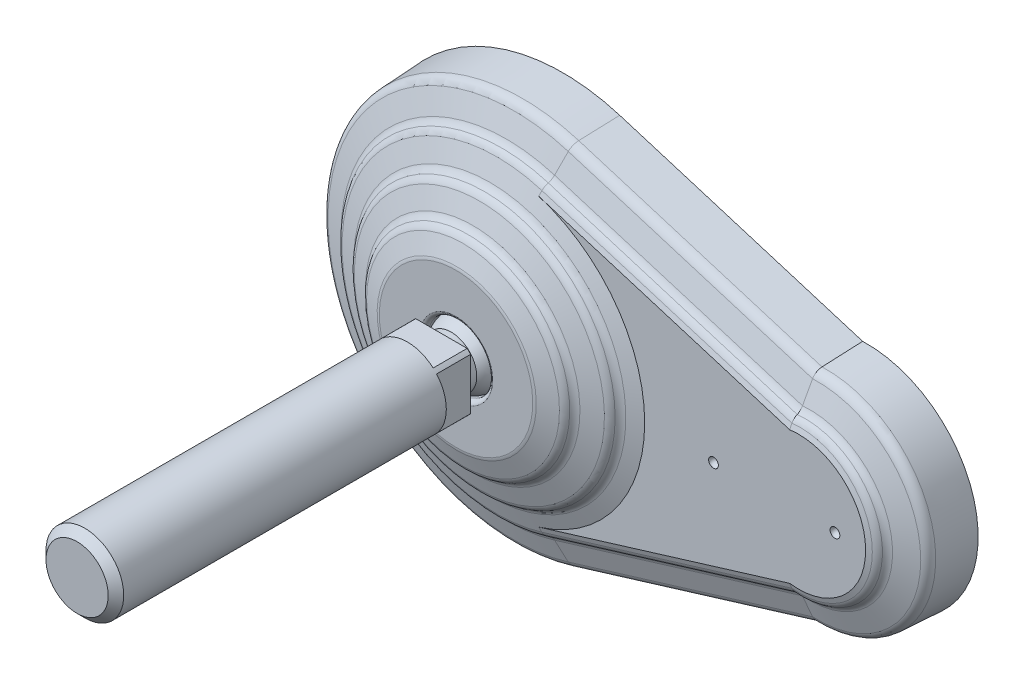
ISO-10303-21;
HEADER;
FILE_DESCRIPTION(('STEP AP214'),'2;1');
FILE_NAME('part.step','',(''),(''),'','','');
FILE_SCHEMA(('AUTOMOTIVE_DESIGN { 1 0 10303 214 1 1 1 1 }'));
ENDSEC;
DATA;
#1=APPLICATION_CONTEXT('core data for automotive mechanical design processes');
#2=APPLICATION_PROTOCOL_DEFINITION('international standard','automotive_design',2000,#1);
#3=PRODUCT_CONTEXT('',#1,'mechanical');
#4=PRODUCT('Part','Part','',(#3));
#5=PRODUCT_RELATED_PRODUCT_CATEGORY('part','',(#4));
#6=PRODUCT_DEFINITION_FORMATION('','',#4);
#7=PRODUCT_DEFINITION_CONTEXT('part definition',#1,'design');
#8=PRODUCT_DEFINITION('design','',#6,#7);
#9=PRODUCT_DEFINITION_SHAPE('','',#8);
#10=(LENGTH_UNIT() NAMED_UNIT(*) SI_UNIT(.MILLI.,.METRE.));
#11=(NAMED_UNIT(*) PLANE_ANGLE_UNIT() SI_UNIT($,.RADIAN.));
#12=(NAMED_UNIT(*) SI_UNIT($,.STERADIAN.) SOLID_ANGLE_UNIT());
#13=UNCERTAINTY_MEASURE_WITH_UNIT(LENGTH_MEASURE(1.E-05),#10,'distance_accuracy_value','');
#14=(GEOMETRIC_REPRESENTATION_CONTEXT(3) GLOBAL_UNCERTAINTY_ASSIGNED_CONTEXT((#13)) GLOBAL_UNIT_ASSIGNED_CONTEXT((#10,
#11,#12)) REPRESENTATION_CONTEXT('',''));
#15=CARTESIAN_POINT('',(0.,0.,0.));
#16=DIRECTION('',(0.,0.,1.));
#17=DIRECTION('',(1.,0.,0.));
#18=AXIS2_PLACEMENT_3D('',#15,#16,#17);
#19=CARTESIAN_POINT('',(0.,0.,34.));
#20=DIRECTION('',(0.,0.,1.));
#21=DIRECTION('',(-1.,0.,0.));
#22=AXIS2_PLACEMENT_3D('',#19,#20,#21);
#23=CYLINDRICAL_SURFACE('',#22,8.);
#24=CARTESIAN_POINT('',(0.,0.,100.4));
#25=DIRECTION('',(0.,0.,1.));
#26=DIRECTION('',(-1.,0.,0.));
#27=AXIS2_PLACEMENT_3D('',#24,#25,#26);
#28=CIRCLE('',#27,8.);
#29=CARTESIAN_POINT('',(-8.,0.,100.4));
#30=VERTEX_POINT('',#29);
#31=EDGE_CURVE('E9',#30,#30,#28,.F.);
#32=ORIENTED_EDGE('',*,*,#31,.T.);
#33=EDGE_LOOP('',(#32));
#34=FACE_BOUND('',#33,.T.);
#35=DIRECTION('',(0.,0.,1.));
#36=VECTOR('',#35,1.);
#37=CARTESIAN_POINT('',(-5.29150262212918,-6.,34.));
#38=LINE('',#37,#36);
#39=CARTESIAN_POINT('',(-5.29150262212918,-6.,34.));
#40=VERTEX_POINT('',#39);
#41=CARTESIAN_POINT('',(-5.29150262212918,-6.,27.));
#42=VERTEX_POINT('',#41);
#43=EDGE_CURVE('E415',#40,#42,#38,.F.);
#44=ORIENTED_EDGE('',*,*,#43,.F.);
#45=CARTESIAN_POINT('',(0.,0.,34.));
#46=DIRECTION('',(0.,0.,1.));
#47=DIRECTION('',(0.,-1.,0.));
#48=AXIS2_PLACEMENT_3D('',#45,#46,#47);
#49=CIRCLE('',#48,8.);
#50=CARTESIAN_POINT('',(5.29150262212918,-6.,34.));
#51=VERTEX_POINT('',#50);
#52=EDGE_CURVE('E500',#40,#51,#49,.T.);
#53=ORIENTED_EDGE('',*,*,#52,.T.);
#54=DIRECTION('',(0.,0.,1.));
#55=VECTOR('',#54,1.);
#56=CARTESIAN_POINT('',(5.29150262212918,-6.,34.));
#57=LINE('',#56,#55);
#58=CARTESIAN_POINT('',(5.29150262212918,-6.,27.));
#59=VERTEX_POINT('',#58);
#60=EDGE_CURVE('E420',#59,#51,#57,.T.);
#61=ORIENTED_EDGE('',*,*,#60,.F.);
#62=CARTESIAN_POINT('',(0.,0.,27.));
#63=DIRECTION('',(0.,0.,1.));
#64=DIRECTION('',(-1.,0.,0.));
#65=AXIS2_PLACEMENT_3D('',#62,#63,#64);
#66=CIRCLE('',#65,8.);
#67=CARTESIAN_POINT('',(6.,-5.29150262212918,27.));
#68=VERTEX_POINT('',#67);
#69=EDGE_CURVE('E533',#59,#68,#66,.T.);
#70=ORIENTED_EDGE('',*,*,#69,.T.);
#71=DIRECTION('',(0.,0.,1.));
#72=VECTOR('',#71,1.);
#73=CARTESIAN_POINT('',(6.,-5.29150262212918,34.));
#74=LINE('',#73,#72);
#75=CARTESIAN_POINT('',(6.,-5.29150262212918,34.));
#76=VERTEX_POINT('',#75);
#77=EDGE_CURVE('E423',#76,#68,#74,.F.);
#78=ORIENTED_EDGE('',*,*,#77,.F.);
#79=CARTESIAN_POINT('',(6.,5.29150262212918,34.));
#80=VERTEX_POINT('',#79);
#81=EDGE_CURVE('E417',#76,#80,#49,.T.);
#82=ORIENTED_EDGE('',*,*,#81,.T.);
#83=DIRECTION('',(0.,0.,1.));
#84=VECTOR('',#83,1.);
#85=CARTESIAN_POINT('',(6.,5.29150262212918,34.));
#86=LINE('',#85,#84);
#87=CARTESIAN_POINT('',(6.,5.29150262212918,27.));
#88=VERTEX_POINT('',#87);
#89=EDGE_CURVE('E433',#88,#80,#86,.T.);
#90=ORIENTED_EDGE('',*,*,#89,.F.);
#91=CARTESIAN_POINT('',(5.29150262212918,6.,27.));
#92=VERTEX_POINT('',#91);
#93=EDGE_CURVE('E531',#88,#92,#66,.T.);
#94=ORIENTED_EDGE('',*,*,#93,.T.);
#95=DIRECTION('',(0.,0.,1.));
#96=VECTOR('',#95,1.);
#97=CARTESIAN_POINT('',(5.29150262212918,6.,34.));
#98=LINE('',#97,#96);
#99=CARTESIAN_POINT('',(5.29150262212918,6.,34.));
#100=VERTEX_POINT('',#99);
#101=EDGE_CURVE('E436',#100,#92,#98,.F.);
#102=ORIENTED_EDGE('',*,*,#101,.F.);
#103=CARTESIAN_POINT('',(-5.29150262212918,6.,34.));
#104=VERTEX_POINT('',#103);
#105=EDGE_CURVE('E499',#100,#104,#49,.T.);
#106=ORIENTED_EDGE('',*,*,#105,.T.);
#107=DIRECTION('',(0.,0.,1.));
#108=VECTOR('',#107,1.);
#109=CARTESIAN_POINT('',(-5.29150262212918,6.,34.));
#110=LINE('',#109,#108);
#111=CARTESIAN_POINT('',(-5.29150262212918,6.,27.));
#112=VERTEX_POINT('',#111);
#113=EDGE_CURVE('E447',#112,#104,#110,.T.);
#114=ORIENTED_EDGE('',*,*,#113,.F.);
#115=CARTESIAN_POINT('',(-6.,5.29150262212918,27.));
#116=VERTEX_POINT('',#115);
#117=EDGE_CURVE('E460',#112,#116,#66,.T.);
#118=ORIENTED_EDGE('',*,*,#117,.T.);
#119=DIRECTION('',(0.,0.,1.));
#120=VECTOR('',#119,1.);
#121=CARTESIAN_POINT('',(-6.,5.29150262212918,34.));
#122=LINE('',#121,#120);
#123=CARTESIAN_POINT('',(-6.,5.29150262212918,34.));
#124=VERTEX_POINT('',#123);
#125=EDGE_CURVE('E450',#124,#116,#122,.F.);
#126=ORIENTED_EDGE('',*,*,#125,.F.);
#127=CARTESIAN_POINT('',(-6.,-5.29150262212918,34.));
#128=VERTEX_POINT('',#127);
#129=EDGE_CURVE('E493',#124,#128,#49,.T.);
#130=ORIENTED_EDGE('',*,*,#129,.T.);
#131=DIRECTION('',(0.,0.,1.));
#132=VECTOR('',#131,1.);
#133=CARTESIAN_POINT('',(-6.,-5.29150262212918,34.));
#134=LINE('',#133,#132);
#135=CARTESIAN_POINT('',(-6.,-5.29150262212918,27.));
#136=VERTEX_POINT('',#135);
#137=EDGE_CURVE('E458',#136,#128,#134,.T.);
#138=ORIENTED_EDGE('',*,*,#137,.F.);
#139=EDGE_CURVE('E404',#136,#42,#66,.T.);
#140=ORIENTED_EDGE('',*,*,#139,.T.);
#141=EDGE_LOOP('',(#44,#53,#61,#70,#78,#82,#90,#94,#102,#106,#114,#118,#126,#130,#138,#140));
#142=FACE_BOUND('',#141,.T.);
#143=ADVANCED_FACE('F15',(#34,#142),#23,.T.);
#144=CARTESIAN_POINT('',(64.1644462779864,-21.755748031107,10.3041173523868));
#145=DIRECTION('',(-0.291971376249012,0.9549953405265,-0.0523126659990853));
#146=DIRECTION('',(-0.956304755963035,-0.292371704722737,0.));
#147=AXIS2_PLACEMENT_3D('',#144,#145,#146);
#148=PLANE('',#147);
#149=CARTESIAN_POINT('',(61.6406997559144,-22.5273238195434,10.3043173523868));
#150=CARTESIAN_POINT('',(61.6501805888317,-22.600242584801,8.92023165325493));
#151=CARTESIAN_POINT('',(61.6596900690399,-22.6731526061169,7.53614569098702));
#152=CARTESIAN_POINT('',(61.6787663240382,-22.8189551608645,4.76797324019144));
#153=CARTESIAN_POINT('',(61.6883330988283,-22.8918476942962,3.38388675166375));
#154=CARTESIAN_POINT('',(61.6979285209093,-22.9647314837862,1.9998));
#155=B_SPLINE_CURVE_WITH_KNOTS('',3,(#149,#150,#151,#152,#153,#154),.UNSPECIFIED.,.F.,.F.,(4,2,
4),(0.,4.15811282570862,8.31622565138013),.UNSPECIFIED.);
#156=CARTESIAN_POINT('',(61.6407011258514,-22.5273343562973,10.3041173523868));
#157=VERTEX_POINT('',#156);
#158=CARTESIAN_POINT('',(61.697927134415,-22.9647209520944,2.));
#159=VERTEX_POINT('',#158);
#160=EDGE_CURVE('E1095',#157,#159,#155,.T.);
#161=ORIENTED_EDGE('',*,*,#160,.F.);
#162=DIRECTION('',(-0.956304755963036,-0.292371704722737,0.));
#163=VECTOR('',#162,1.);
#164=CARTESIAN_POINT('',(64.1644462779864,-21.755748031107,10.3041173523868));
#165=LINE('',#164,#163);
#166=CARTESIAN_POINT('',(11.5676847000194,-37.8361917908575,10.3041173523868));
#167=VERTEX_POINT('',#166);
#168=EDGE_CURVE('E1156',#157,#167,#165,.T.);
#169=ORIENTED_EDGE('',*,*,#168,.T.);
#170=DIRECTION('',(-0.0152947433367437,0.050026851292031,0.998630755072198));
#171=VECTOR('',#170,1.);
#172=CARTESIAN_POINT('',(11.6948681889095,-38.2521902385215,2.));
#173=LINE('',#172,#171);
#174=CARTESIAN_POINT('',(11.6948681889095,-38.2521902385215,2.));
#175=VERTEX_POINT('',#174);
#176=EDGE_CURVE('E1166',#175,#167,#173,.T.);
#177=ORIENTED_EDGE('',*,*,#176,.F.);
#178=DIRECTION('',(-0.956304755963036,-0.292371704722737,0.));
#179=VECTOR('',#178,1.);
#180=CARTESIAN_POINT('',(64.2916297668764,-22.1717464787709,2.));
#181=LINE('',#180,#179);
#182=EDGE_CURVE('E186',#159,#175,#181,.T.);
#183=ORIENTED_EDGE('',*,*,#182,.F.);
#184=EDGE_LOOP('',(#161,#169,#177,#183));
#185=FACE_BOUND('',#184,.T.);
#186=ADVANCED_FACE('F353',(#185),#148,.F.);
#187=CARTESIAN_POINT('',(61.6120778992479,-13.407327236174,16.));
#188=DIRECTION('',(-0.102070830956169,0.333858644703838,-0.937080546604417));
#189=DIRECTION('',(0.,0.942000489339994,0.335611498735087));
#190=AXIS2_PLACEMENT_3D('',#187,#188,#189);
#191=PLANE('',#190);
#192=CARTESIAN_POINT('',(60.6773763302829,-13.6925328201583,16.0002));
#193=CARTESIAN_POINT('',(60.6914441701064,-13.863175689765,15.9378718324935));
#194=CARTESIAN_POINT('',(60.7058313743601,-14.0337829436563,15.8755215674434));
#195=CARTESIAN_POINT('',(60.735244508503,-14.3749261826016,15.7507768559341));
#196=CARTESIAN_POINT('',(60.750270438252,-14.5454621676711,15.6883824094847));
#197=CARTESIAN_POINT('',(60.7656157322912,-14.7159625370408,15.6259658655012));
#198=B_SPLINE_CURVE_WITH_KNOTS('',3,(#192,#193,#194,#195,#196,#197),.UNSPECIFIED.,.F.,.F.,(4,2,
4),(0.,0.546637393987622,1.09327466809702),.UNSPECIFIED.);
#199=CARTESIAN_POINT('',(60.677421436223,-13.6930803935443,16.));
#200=VERTEX_POINT('',#199);
#201=CARTESIAN_POINT('',(60.765566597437,-14.7154161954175,15.6261658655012));
#202=VERTEX_POINT('',#201);
#203=EDGE_CURVE('E166',#200,#202,#198,.T.);
#204=ORIENTED_EDGE('',*,*,#203,.F.);
#205=DIRECTION('',(-0.956304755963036,-0.292371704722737,0.));
#206=VECTOR('',#205,1.);
#207=CARTESIAN_POINT('',(61.6120778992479,-13.407327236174,16.));
#208=LINE('',#207,#206);
#209=CARTESIAN_POINT('',(9.01531632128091,-29.4877709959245,16.));
#210=VERTEX_POINT('',#209);
#211=EDGE_CURVE('E170',#200,#210,#208,.T.);
#212=ORIENTED_EDGE('',*,*,#211,.T.);
#213=DIRECTION('',(-0.273975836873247,0.896134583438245,0.349113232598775));
#214=VECTOR('',#213,1.);
#215=CARTESIAN_POINT('',(9.30869253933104,-30.4473613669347,15.6261658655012));
#216=LINE('',#215,#214);
#217=CARTESIAN_POINT('',(9.30869253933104,-30.4473613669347,15.6261658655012));
#218=VERTEX_POINT('',#217);
#219=EDGE_CURVE('E1181',#218,#210,#216,.T.);
#220=ORIENTED_EDGE('',*,*,#219,.F.);
#221=DIRECTION('',(-0.956304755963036,-0.292371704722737,0.));
#222=VECTOR('',#221,1.);
#223=CARTESIAN_POINT('',(61.905454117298,-14.3669176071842,15.6261658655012));
#224=LINE('',#223,#222);
#225=EDGE_CURVE('E172',#202,#218,#224,.T.);
#226=ORIENTED_EDGE('',*,*,#225,.F.);
#227=EDGE_LOOP('',(#204,#212,#220,#226));
#228=FACE_BOUND('',#227,.T.);
#229=ADVANCED_FACE('F168',(#228),#191,.F.);
#230=CARTESIAN_POINT('',(62.7507979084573,-17.131912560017,15.5370123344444));
#231=DIRECTION('',(-0.956304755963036,-0.292371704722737,0.));
#232=DIRECTION('',(0.292371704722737,-0.956304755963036,0.));
#233=AXIS2_PLACEMENT_3D('',#230,#231,#232);
#234=CYLINDRICAL_SURFACE('',#233,2.00700000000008);
#235=DIRECTION('',(-0.956304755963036,-0.292371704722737,0.));
#236=VECTOR('',#235,1.);
#237=CARTESIAN_POINT('',(62.545973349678,-16.4619616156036,13.656251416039));
#238=LINE('',#237,#236);
#239=CARTESIAN_POINT('',(60.9818619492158,-16.9401584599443,13.656251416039));
#240=VERTEX_POINT('',#239);
#241=CARTESIAN_POINT('',(9.949211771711,-32.5424053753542,13.656251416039));
#242=VERTEX_POINT('',#241);
#243=EDGE_CURVE('E1160',#240,#242,#238,.T.);
#244=ORIENTED_EDGE('',*,*,#243,.F.);
#245=CARTESIAN_POINT('',(60.9819185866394,-16.9407028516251,13.656051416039));
#246=CARTESIAN_POINT('',(60.9763282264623,-16.8869710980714,13.675784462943));
#247=CARTESIAN_POINT('',(60.9708503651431,-16.8340792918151,13.697757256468));
#248=CARTESIAN_POINT('',(60.9601474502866,-16.7302929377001,13.7460604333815));
#249=CARTESIAN_POINT('',(60.9549224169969,-16.6793985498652,13.77239116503));
#250=CARTESIAN_POINT('',(60.9396574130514,-16.5300811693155,13.8578002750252));
#251=CARTESIAN_POINT('',(60.9300410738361,-16.4351542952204,13.9232476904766));
#252=CARTESIAN_POINT('',(60.9121877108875,-16.2575900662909,14.0693279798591));
#253=CARTESIAN_POINT('',(60.903952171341,-16.1749659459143,14.1499769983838));
#254=CARTESIAN_POINT('',(60.8890756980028,-16.0247595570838,14.3241094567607));
#255=CARTESIAN_POINT('',(60.8824301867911,-15.9571341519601,14.4175548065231));
#256=CARTESIAN_POINT('',(60.8754548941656,-15.8858007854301,14.5364334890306));
#257=CARTESIAN_POINT('',(60.8742920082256,-15.8738939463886,14.5571086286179));
#258=CARTESIAN_POINT('',(60.8720425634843,-15.8508368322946,14.59885583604));
#259=CARTESIAN_POINT('',(60.8709559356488,-15.839685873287,14.6199275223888));
#260=CARTESIAN_POINT('',(60.869906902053,-15.8289098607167,14.6412000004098));
#261=B_SPLINE_CURVE_WITH_KNOTS('',3,(#245,#246,#247,#248,#249,#250,#251,#252,#253,#254,#255,
#256,#257,#258,#259,#260),.UNSPECIFIED.,.F.,.F.,(4,2,2,2,2,2,2,4),(0.,0.172434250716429,
0.344882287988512,0.690191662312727,1.0358698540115,1.38054058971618,1.4521941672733,
1.52378201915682),.UNSPECIFIED.);
#262=CARTESIAN_POINT('',(60.8699167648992,-15.8290111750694,14.6410000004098));
#263=VERTEX_POINT('',#262);
#264=EDGE_CURVE('E278',#240,#263,#261,.T.);
#265=ORIENTED_EDGE('',*,*,#264,.T.);
#266=DIRECTION('',(-0.956304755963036,-0.292371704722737,0.));
#267=VECTOR('',#266,1.);
#268=CARTESIAN_POINT('',(62.2257313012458,-15.4144970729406,14.6410000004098));
#269=LINE('',#268,#267);
#270=CARTESIAN_POINT('',(9.62896972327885,-31.4949408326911,14.6410000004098));
#271=VERTEX_POINT('',#270);
#272=EDGE_CURVE('E1162',#263,#271,#269,.T.);
#273=ORIENTED_EDGE('',*,*,#272,.T.);
#274=CARTESIAN_POINT('',(10.1540363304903,-33.2123563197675,15.5370123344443));
#275=DIRECTION('',(0.956304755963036,0.292371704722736,0.));
#276=DIRECTION('',(-0.292371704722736,0.956304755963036,0.));
#277=AXIS2_PLACEMENT_3D('',#274,#275,#276);
#278=CIRCLE('',#277,2.00700000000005);
#279=EDGE_CURVE('E1175',#242,#271,#278,.T.);
#280=ORIENTED_EDGE('',*,*,#279,.F.);
#281=EDGE_LOOP('',(#244,#265,#273,#280));
#282=FACE_BOUND('',#281,.T.);
#283=ADVANCED_FACE('F330',(#282),#234,.F.);
#284=CARTESIAN_POINT('',(62.545973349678,-16.4619616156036,13.656251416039));
#285=DIRECTION('',(-0.102055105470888,0.333807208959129,-0.937100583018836));
#286=DIRECTION('',(0.,0.942019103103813,0.335559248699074));
#287=AXIS2_PLACEMENT_3D('',#284,#285,#286);
#288=PLANE('',#287);
#289=CARTESIAN_POINT('',(60.9818053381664,-16.9396143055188,13.656451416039));
#290=CARTESIAN_POINT('',(61.0189355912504,-17.2964789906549,13.5252879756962));
#291=CARTESIAN_POINT('',(61.0571375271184,-17.653206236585,13.3940567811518));
#292=CARTESIAN_POINT('',(61.1355151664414,-18.3663907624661,13.1314756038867));
#293=CARTESIAN_POINT('',(61.1756908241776,-18.7228480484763,13.0001256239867));
#294=CARTESIAN_POINT('',(61.2578477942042,-19.435511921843,12.7373183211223));
#295=CARTESIAN_POINT('',(61.2998290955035,-19.7917185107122,12.6058609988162));
#296=CARTESIAN_POINT('',(61.3854616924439,-20.5039033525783,12.3428458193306));
#297=CARTESIAN_POINT('',(61.4291130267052,-20.8598816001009,12.2112879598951));
#298=CARTESIAN_POINT('',(61.4735304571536,-21.2157475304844,12.0796866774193));
#299=B_SPLINE_CURVE_WITH_KNOTS('',3,(#289,#290,#291,#292,#293,#294,#295,#296,#297,#298),
.UNSPECIFIED.,.F.,.F.,(4,2,2,2,4),(0.,1.14603990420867,2.29205327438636,3.43805966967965,
4.58409258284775),.UNSPECIFIED.);
#300=CARTESIAN_POINT('',(61.4734629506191,-21.2152067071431,12.0798866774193));
#301=VERTEX_POINT('',#300);
#302=EDGE_CURVE('E311',#240,#301,#299,.T.);
#303=ORIENTED_EDGE('',*,*,#302,.F.);
#304=ORIENTED_EDGE('',*,*,#243,.T.);
#305=DIRECTION('',(-0.273981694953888,0.896153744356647,0.349059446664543));
#306=VECTOR('',#305,1.);
#307=CARTESIAN_POINT('',(11.1865227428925,-36.5894672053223,12.0798866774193));
#308=LINE('',#307,#306);
#309=CARTESIAN_POINT('',(11.1865227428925,-36.5894672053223,12.0798866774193));
#310=VERTEX_POINT('',#309);
#311=EDGE_CURVE('E1172',#310,#242,#308,.T.);
#312=ORIENTED_EDGE('',*,*,#311,.F.);
#313=DIRECTION('',(-0.956304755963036,-0.292371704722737,0.));
#314=VECTOR('',#313,1.);
#315=CARTESIAN_POINT('',(63.7832843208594,-20.5090234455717,12.0798866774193));
#316=LINE('',#315,#314);
#317=EDGE_CURVE('E1158',#301,#310,#316,.T.);
#318=ORIENTED_EDGE('',*,*,#317,.F.);
#319=EDGE_LOOP('',(#303,#304,#312,#318));
#320=FACE_BOUND('',#319,.T.);
#321=ADVANCED_FACE('F325',(#320),#288,.F.);
#322=CARTESIAN_POINT('',(64.2916297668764,22.1717464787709,2.));
#323=DIRECTION('',(-0.291971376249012,-0.9549953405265,-0.0523126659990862));
#324=DIRECTION('',(0.956304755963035,-0.292371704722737,0.));
#325=AXIS2_PLACEMENT_3D('',#322,#323,#324);
#326=PLANE('',#325);
#327=CARTESIAN_POINT('',(61.6979285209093,22.9647314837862,1.9998));
#328=CARTESIAN_POINT('',(61.6883330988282,22.8918476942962,3.38388675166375));
#329=CARTESIAN_POINT('',(61.6787663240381,22.8189551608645,4.76797324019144));
#330=CARTESIAN_POINT('',(61.6596900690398,22.6731526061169,7.53614569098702));
#331=CARTESIAN_POINT('',(61.6501805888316,22.600242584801,8.92023165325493));
#332=CARTESIAN_POINT('',(61.6406997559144,22.5273238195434,10.3043173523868));
#333=B_SPLINE_CURVE_WITH_KNOTS('',3,(#327,#328,#329,#330,#331,#332),.UNSPECIFIED.,.F.,.F.,(4,2,
4),(0.,4.15811282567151,8.31622565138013),.UNSPECIFIED.);
#334=CARTESIAN_POINT('',(61.6979271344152,22.9647209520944,2.));
#335=VERTEX_POINT('',#334);
#336=CARTESIAN_POINT('',(61.6407011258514,22.5273343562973,10.3041173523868));
#337=VERTEX_POINT('',#336);
#338=EDGE_CURVE('E1088',#335,#337,#333,.T.);
#339=ORIENTED_EDGE('',*,*,#338,.F.);
#340=DIRECTION('',(-0.956304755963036,0.292371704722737,0.));
#341=VECTOR('',#340,1.);
#342=CARTESIAN_POINT('',(64.2916297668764,22.1717464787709,2.));
#343=LINE('',#342,#341);
#344=CARTESIAN_POINT('',(11.6948681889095,38.2521902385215,2.));
#345=VERTEX_POINT('',#344);
#346=EDGE_CURVE('E1154',#335,#345,#343,.T.);
#347=ORIENTED_EDGE('',*,*,#346,.T.);
#348=DIRECTION('',(-0.0152947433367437,-0.050026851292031,0.998630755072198));
#349=VECTOR('',#348,1.);
#350=CARTESIAN_POINT('',(11.6948681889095,38.2521902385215,2.));
#351=LINE('',#350,#349);
#352=CARTESIAN_POINT('',(11.5676847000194,37.8361917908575,10.3041173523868));
#353=VERTEX_POINT('',#352);
#354=EDGE_CURVE('E1183',#345,#353,#351,.T.);
#355=ORIENTED_EDGE('',*,*,#354,.T.);
#356=DIRECTION('',(-0.956304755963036,0.292371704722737,0.));
#357=VECTOR('',#356,1.);
#358=CARTESIAN_POINT('',(64.1644462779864,21.755748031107,10.3041173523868));
#359=LINE('',#358,#357);
#360=EDGE_CURVE('E1152',#337,#353,#359,.T.);
#361=ORIENTED_EDGE('',*,*,#360,.F.);
#362=EDGE_LOOP('',(#339,#347,#355,#361));
#363=FACE_BOUND('',#362,.T.);
#364=ADVANCED_FACE('F329',(#363),#326,.F.);
#365=CARTESIAN_POINT('',(63.7832843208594,20.5090234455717,12.0798866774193));
#366=DIRECTION('',(-0.102055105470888,-0.333807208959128,-0.937100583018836));
#367=DIRECTION('',(0.,0.942019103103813,-0.335559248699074));
#368=AXIS2_PLACEMENT_3D('',#365,#366,#367);
#369=PLANE('',#368);
#370=CARTESIAN_POINT('',(61.4735304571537,21.2157475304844,12.0796866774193));
#371=CARTESIAN_POINT('',(61.4291130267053,20.8598816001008,12.2112879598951));
#372=CARTESIAN_POINT('',(61.3854616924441,20.5039033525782,12.3428458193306));
#373=CARTESIAN_POINT('',(61.2998290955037,19.7917185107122,12.6058609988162));
#374=CARTESIAN_POINT('',(61.2578477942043,19.435511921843,12.7373183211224));
#375=CARTESIAN_POINT('',(61.1756908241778,18.7228480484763,13.0001256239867));
#376=CARTESIAN_POINT('',(61.1355151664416,18.3663907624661,13.1314756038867));
#377=CARTESIAN_POINT('',(61.0571375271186,17.653206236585,13.3940567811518));
#378=CARTESIAN_POINT('',(61.0189355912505,17.2964789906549,13.5252879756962));
#379=CARTESIAN_POINT('',(60.9818053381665,16.9396143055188,13.656451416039));
#380=B_SPLINE_CURVE_WITH_KNOTS('',3,(#370,#371,#372,#373,#374,#375,#376,#377,#378,#379),
.UNSPECIFIED.,.F.,.F.,(4,2,2,2,4),(0.,1.14603291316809,2.29203930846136,3.43805267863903,
4.58409258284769),.UNSPECIFIED.);
#381=CARTESIAN_POINT('',(61.4734629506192,21.2152067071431,12.0798866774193));
#382=VERTEX_POINT('',#381);
#383=CARTESIAN_POINT('',(60.9818619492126,16.9401584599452,13.656251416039));
#384=VERTEX_POINT('',#383);
#385=EDGE_CURVE('E305',#382,#384,#380,.T.);
#386=ORIENTED_EDGE('',*,*,#385,.F.);
#387=DIRECTION('',(-0.956304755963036,0.292371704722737,0.));
#388=VECTOR('',#387,1.);
#389=CARTESIAN_POINT('',(63.7832843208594,20.5090234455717,12.0798866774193));
#390=LINE('',#389,#388);
#391=CARTESIAN_POINT('',(11.1865227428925,36.5894672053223,12.0798866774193));
#392=VERTEX_POINT('',#391);
#393=EDGE_CURVE('E1150',#382,#392,#390,.T.);
#394=ORIENTED_EDGE('',*,*,#393,.T.);
#395=DIRECTION('',(-0.273981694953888,-0.896153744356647,0.349059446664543));
#396=VECTOR('',#395,1.);
#397=CARTESIAN_POINT('',(11.1865227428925,36.5894672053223,12.0798866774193));
#398=LINE('',#397,#396);
#399=CARTESIAN_POINT('',(9.949211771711,32.5424053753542,13.656251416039));
#400=VERTEX_POINT('',#399);
#401=EDGE_CURVE('E1189',#392,#400,#398,.T.);
#402=ORIENTED_EDGE('',*,*,#401,.T.);
#403=DIRECTION('',(-0.956304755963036,0.292371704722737,0.));
#404=VECTOR('',#403,1.);
#405=CARTESIAN_POINT('',(62.545973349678,16.4619616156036,13.656251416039));
#406=LINE('',#405,#404);
#407=EDGE_CURVE('E1148',#384,#400,#406,.T.);
#408=ORIENTED_EDGE('',*,*,#407,.F.);
#409=EDGE_LOOP('',(#386,#394,#402,#408));
#410=FACE_BOUND('',#409,.T.);
#411=ADVANCED_FACE('F266',(#410),#369,.F.);
#412=CARTESIAN_POINT('',(62.7507979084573,17.1319125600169,15.5370123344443));
#413=DIRECTION('',(-0.956304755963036,0.292371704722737,0.));
#414=DIRECTION('',(-0.292371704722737,-0.956304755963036,0.));
#415=AXIS2_PLACEMENT_3D('',#412,#413,#414);
#416=CYLINDRICAL_SURFACE('',#415,2.007);
#417=DIRECTION('',(-0.956304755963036,0.292371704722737,0.));
#418=VECTOR('',#417,1.);
#419=CARTESIAN_POINT('',(62.2257313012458,15.4144970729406,14.6410000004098));
#420=LINE('',#419,#418);
#421=CARTESIAN_POINT('',(60.8699167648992,15.8290111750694,14.6410000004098));
#422=VERTEX_POINT('',#421);
#423=CARTESIAN_POINT('',(9.62896972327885,31.4949408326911,14.6410000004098));
#424=VERTEX_POINT('',#423);
#425=EDGE_CURVE('E1146',#422,#424,#420,.T.);
#426=ORIENTED_EDGE('',*,*,#425,.F.);
#427=CARTESIAN_POINT('',(60.869906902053,15.8289098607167,14.6412000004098));
#428=CARTESIAN_POINT('',(60.8724049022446,15.8545692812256,14.5905409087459));
#429=CARTESIAN_POINT('',(60.8751177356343,15.882373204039,14.5410120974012));
#430=CARTESIAN_POINT('',(60.8809599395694,15.9420653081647,14.4445128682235));
#431=CARTESIAN_POINT('',(60.8840892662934,15.9739530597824,14.3975421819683));
#432=CARTESIAN_POINT('',(60.8940798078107,16.0754098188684,14.2609440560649));
#433=CARTESIAN_POINT('',(60.9015461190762,16.1507985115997,14.1755790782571));
#434=CARTESIAN_POINT('',(60.9179069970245,16.3146445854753,14.0187596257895));
#435=CARTESIAN_POINT('',(60.9268017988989,16.4031041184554,13.9473074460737));
#436=CARTESIAN_POINT('',(60.9458071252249,16.5904449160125,13.8202080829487));
#437=CARTESIAN_POINT('',(60.9559150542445,16.6893038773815,13.7645279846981));
#438=CARTESIAN_POINT('',(60.9690169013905,16.8162843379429,13.7062217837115));
#439=CARTESIAN_POINT('',(60.9715630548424,16.8409104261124,13.6954970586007));
#440=CARTESIAN_POINT('',(60.9767040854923,16.8905299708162,13.6750365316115));
#441=CARTESIAN_POINT('',(60.9792989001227,16.9155229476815,13.6652995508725));
#442=CARTESIAN_POINT('',(60.9819185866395,16.940702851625,13.656051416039));
#443=B_SPLINE_CURVE_WITH_KNOTS('',3,(#427,#428,#429,#430,#431,#432,#433,#434,#435,#436,#437,
#438,#439,#440,#441,#442),.UNSPECIFIED.,.F.,.F.,(4,2,2,2,2,2,2,4),(0.,0.170415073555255,
0.340812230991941,0.68143537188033,1.0221146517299,1.36207763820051,1.44300799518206,
1.52384059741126),.UNSPECIFIED.);
#444=EDGE_CURVE('E271',#422,#384,#443,.T.);
#445=ORIENTED_EDGE('',*,*,#444,.T.);
#446=ORIENTED_EDGE('',*,*,#407,.T.);
#447=CARTESIAN_POINT('',(10.1540363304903,33.2123563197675,15.5370123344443));
#448=DIRECTION('',(-0.956304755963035,0.292371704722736,0.));
#449=DIRECTION('',(-0.292371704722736,-0.956304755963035,0.));
#450=AXIS2_PLACEMENT_3D('',#447,#448,#449);
#451=CIRCLE('',#450,2.00700000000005);
#452=EDGE_CURVE('E1192',#400,#424,#451,.T.);
#453=ORIENTED_EDGE('',*,*,#452,.T.);
#454=EDGE_LOOP('',(#426,#445,#446,#453));
#455=FACE_BOUND('',#454,.T.);
#456=ADVANCED_FACE('F253',(#455),#416,.F.);
#457=CARTESIAN_POINT('',(61.905454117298,14.3669176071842,15.6261658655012));
#458=DIRECTION('',(-0.102070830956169,-0.333858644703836,-0.937080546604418));
#459=DIRECTION('',(0.,0.942000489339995,-0.335611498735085));
#460=AXIS2_PLACEMENT_3D('',#457,#458,#459);
#461=PLANE('',#460);
#462=CARTESIAN_POINT('',(60.7656157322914,14.7159625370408,15.6259658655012));
#463=CARTESIAN_POINT('',(60.750270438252,14.5454621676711,15.6883824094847));
#464=CARTESIAN_POINT('',(60.7352445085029,14.3749261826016,15.7507768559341));
#465=CARTESIAN_POINT('',(60.70583137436,14.0337829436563,15.8755215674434));
#466=CARTESIAN_POINT('',(60.6914441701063,13.863175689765,15.9378718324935));
#467=CARTESIAN_POINT('',(60.6773763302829,13.6925328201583,16.0002));
#468=B_SPLINE_CURVE_WITH_KNOTS('',3,(#462,#463,#464,#465,#466,#467),.UNSPECIFIED.,.F.,.F.,(4,2,
4),(0.,0.546637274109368,1.09327466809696),.UNSPECIFIED.);
#469=CARTESIAN_POINT('',(60.7655665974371,14.7154161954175,15.6261658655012));
#470=VERTEX_POINT('',#469);
#471=CARTESIAN_POINT('',(60.6774214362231,13.6930803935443,16.));
#472=VERTEX_POINT('',#471);
#473=EDGE_CURVE('E191',#470,#472,#468,.T.);
#474=ORIENTED_EDGE('',*,*,#473,.F.);
#475=DIRECTION('',(-0.956304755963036,0.292371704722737,0.));
#476=VECTOR('',#475,1.);
#477=CARTESIAN_POINT('',(61.905454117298,14.3669176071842,15.6261658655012));
#478=LINE('',#477,#476);
#479=CARTESIAN_POINT('',(9.30869253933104,30.4473613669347,15.6261658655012));
#480=VERTEX_POINT('',#479);
#481=EDGE_CURVE('E1144',#470,#480,#478,.T.);
#482=ORIENTED_EDGE('',*,*,#481,.T.);
#483=DIRECTION('',(-0.273975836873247,-0.896134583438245,0.349113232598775));
#484=VECTOR('',#483,1.);
#485=CARTESIAN_POINT('',(9.30869253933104,30.4473613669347,15.6261658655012));
#486=LINE('',#485,#484);
#487=CARTESIAN_POINT('',(9.01531632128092,29.4877709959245,16.));
#488=VERTEX_POINT('',#487);
#489=EDGE_CURVE('E1198',#480,#488,#486,.T.);
#490=ORIENTED_EDGE('',*,*,#489,.T.);
#491=DIRECTION('',(-0.956304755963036,0.292371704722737,0.));
#492=VECTOR('',#491,1.);
#493=CARTESIAN_POINT('',(61.6120778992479,13.4073272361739,16.));
#494=LINE('',#493,#492);
#495=EDGE_CURVE('E1142',#472,#488,#494,.T.);
#496=ORIENTED_EDGE('',*,*,#495,.F.);
#497=EDGE_LOOP('',(#474,#482,#490,#496));
#498=FACE_BOUND('',#497,.T.);
#499=ADVANCED_FACE('F248',(#498),#461,.F.);
#500=CARTESIAN_POINT('',(0.,0.,2.));
#501=DIRECTION('',(0.,0.,1.));
#502=DIRECTION('',(-1.,0.,0.));
#503=AXIS2_PLACEMENT_3D('',#500,#501,#502);
#504=PLANE('',#503);
#505=ORIENTED_EDGE('',*,*,#346,.F.);
#506=CARTESIAN_POINT('',(62.5,0.,2.));
#507=DIRECTION('',(0.,0.,1.));
#508=DIRECTION('',(0.,-1.,0.));
#509=AXIS2_PLACEMENT_3D('',#506,#507,#508);
#510=CIRCLE('',#509,22.9787234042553);
#511=EDGE_CURVE('E177',#159,#335,#510,.T.);
#512=ORIENTED_EDGE('',*,*,#511,.F.);
#513=ORIENTED_EDGE('',*,*,#182,.T.);
#514=CARTESIAN_POINT('',(0.,0.,2.));
#515=DIRECTION('',(0.,0.,1.));
#516=DIRECTION('',(-1.,0.,0.));
#517=AXIS2_PLACEMENT_3D('',#514,#515,#516);
#518=CIRCLE('',#517,40.);
#519=EDGE_CURVE('E244',#345,#175,#518,.T.);
#520=ORIENTED_EDGE('',*,*,#519,.F.);
#521=EDGE_LOOP('',(#505,#512,#513,#520));
#522=FACE_BOUND('',#521,.T.);
#523=CARTESIAN_POINT('',(65.,0.,2.));
#524=DIRECTION('',(0.,0.,1.));
#525=DIRECTION('',(1.,0.,0.));
#526=AXIS2_PLACEMENT_3D('',#523,#524,#525);
#527=CIRCLE('',#526,16.);
#528=CARTESIAN_POINT('',(69.9230769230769,-15.2237746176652,2.));
#529=VERTEX_POINT('',#528);
#530=CARTESIAN_POINT('',(69.9230769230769,15.2237746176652,2.));
#531=VERTEX_POINT('',#530);
#532=EDGE_CURVE('E568',#529,#531,#527,.T.);
#533=ORIENTED_EDGE('',*,*,#532,.T.);
#534=DIRECTION('',(-0.951485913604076,0.307692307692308,0.));
#535=VECTOR('',#534,1.);
#536=CARTESIAN_POINT('',(69.9230769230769,15.2237746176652,2.));
#537=LINE('',#536,#535);
#538=CARTESIAN_POINT('',(11.0769230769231,34.2534928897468,2.));
#539=VERTEX_POINT('',#538);
#540=EDGE_CURVE('E32',#531,#539,#537,.T.);
#541=ORIENTED_EDGE('',*,*,#540,.T.);
#542=CARTESIAN_POINT('',(0.,0.,2.));
#543=DIRECTION('',(0.,0.,1.));
#544=DIRECTION('',(1.,0.,0.));
#545=AXIS2_PLACEMENT_3D('',#542,#543,#544);
#546=CIRCLE('',#545,36.);
#547=CARTESIAN_POINT('',(11.0769230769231,-34.2534928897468,2.));
#548=VERTEX_POINT('',#547);
#549=EDGE_CURVE('E575',#539,#548,#546,.T.);
#550=ORIENTED_EDGE('',*,*,#549,.T.);
#551=DIRECTION('',(0.951485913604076,0.307692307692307,0.));
#552=VECTOR('',#551,1.);
#553=CARTESIAN_POINT('',(11.0769230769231,-34.2534928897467,2.));
#554=LINE('',#553,#552);
#555=EDGE_CURVE('E570',#548,#529,#554,.T.);
#556=ORIENTED_EDGE('',*,*,#555,.T.);
#557=EDGE_LOOP('',(#533,#541,#550,#556));
#558=FACE_BOUND('',#557,.T.);
#559=ADVANCED_FACE('F252',(#522,#558),#504,.F.);
#560=CARTESIAN_POINT('',(0.,0.,2.));
#561=DIRECTION('',(0.,0.,-1.));
#562=DIRECTION('',(1.,0.,0.));
#563=AXIS2_PLACEMENT_3D('',#560,#561,#562);
#564=CONICAL_SURFACE('',#563,40.,0.0523365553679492);
#565=CARTESIAN_POINT('',(0.,0.,10.3041173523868));
#566=DIRECTION('',(0.,0.,1.));
#567=DIRECTION('',(-1.,0.,0.));
#568=AXIS2_PLACEMENT_3D('',#565,#566,#567);
#569=CIRCLE('',#568,39.5649938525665);
#570=EDGE_CURVE('E1212',#353,#167,#569,.T.);
#571=ORIENTED_EDGE('',*,*,#570,.F.);
#572=ORIENTED_EDGE('',*,*,#354,.F.);
#573=ORIENTED_EDGE('',*,*,#519,.T.);
#574=ORIENTED_EDGE('',*,*,#176,.T.);
#575=EDGE_LOOP('',(#571,#572,#573,#574));
#576=FACE_BOUND('',#575,.T.);
#577=ADVANCED_FACE('F1000',(#576),#564,.T.);
#578=CARTESIAN_POINT('',(0.,0.,10.1991258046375));
#579=DIRECTION('',(0.,0.,1.));
#580=DIRECTION('',(-1.,0.,0.));
#581=AXIS2_PLACEMENT_3D('',#578,#579,#580);
#582=TOROIDAL_SURFACE('',#581,37.5607419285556,2.007);
#583=CARTESIAN_POINT('',(0.,0.,12.0798866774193));
#584=DIRECTION('',(0.,0.,1.));
#585=DIRECTION('',(-1.,0.,0.));
#586=AXIS2_PLACEMENT_3D('',#583,#584,#585);
#587=CIRCLE('',#586,38.2613042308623);
#588=EDGE_CURVE('E1210',#392,#310,#587,.T.);
#589=ORIENTED_EDGE('',*,*,#588,.F.);
#590=CARTESIAN_POINT('',(10.9816981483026,35.9195161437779,10.1991258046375));
#591=DIRECTION('',(-0.956304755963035,0.292371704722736,0.));
#592=DIRECTION('',(-0.292371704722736,-0.956304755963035,0.));
#593=AXIS2_PLACEMENT_3D('',#590,#591,#592);
#594=CIRCLE('',#593,2.007);
#595=EDGE_CURVE('E1186',#392,#353,#594,.T.);
#596=ORIENTED_EDGE('',*,*,#595,.T.);
#597=ORIENTED_EDGE('',*,*,#570,.T.);
#598=CARTESIAN_POINT('',(10.9816981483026,-35.9195161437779,10.1991258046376));
#599=DIRECTION('',(0.956304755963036,0.292371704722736,0.));
#600=DIRECTION('',(-0.292371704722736,0.956304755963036,0.));
#601=AXIS2_PLACEMENT_3D('',#598,#599,#600);
#602=CIRCLE('',#601,2.007);
#603=EDGE_CURVE('E1169',#310,#167,#602,.T.);
#604=ORIENTED_EDGE('',*,*,#603,.F.);
#605=EDGE_LOOP('',(#589,#596,#597,#604));
#606=FACE_BOUND('',#605,.T.);
#607=ADVANCED_FACE('F991',(#606),#582,.T.);
#608=CARTESIAN_POINT('',(0.,0.,12.0798866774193));
#609=DIRECTION('',(0.,0.,-1.));
#610=DIRECTION('',(1.,0.,0.));
#611=AXIS2_PLACEMENT_3D('',#608,#609,#610);
#612=CONICAL_SURFACE('',#611,38.2613042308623,1.21422909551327);
#613=CARTESIAN_POINT('',(0.,0.,13.656251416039));
#614=DIRECTION('',(0.,0.,1.));
#615=DIRECTION('',(-1.,0.,0.));
#616=AXIS2_PLACEMENT_3D('',#613,#614,#615);
#617=CIRCLE('',#616,34.0293250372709);
#618=EDGE_CURVE('E1207',#400,#242,#617,.T.);
#619=ORIENTED_EDGE('',*,*,#618,.F.);
#620=ORIENTED_EDGE('',*,*,#401,.F.);
#621=ORIENTED_EDGE('',*,*,#588,.T.);
#622=ORIENTED_EDGE('',*,*,#311,.T.);
#623=EDGE_LOOP('',(#619,#620,#621,#622));
#624=FACE_BOUND('',#623,.T.);
#625=ADVANCED_FACE('F982',(#624),#612,.T.);
#626=CARTESIAN_POINT('',(0.,0.,15.5370123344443));
#627=DIRECTION('',(0.,0.,1.));
#628=DIRECTION('',(-1.,0.,0.));
#629=AXIS2_PLACEMENT_3D('',#626,#627,#628);
#630=TOROIDAL_SURFACE('',#629,34.7298872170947,2.00700000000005);
#631=CARTESIAN_POINT('',(0.,0.,14.6410000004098));
#632=DIRECTION('',(0.,0.,1.));
#633=DIRECTION('',(-1.,0.,0.));
#634=AXIS2_PLACEMENT_3D('',#631,#632,#633);
#635=CIRCLE('',#634,32.9339999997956);
#636=EDGE_CURVE('E1204',#424,#271,#635,.T.);
#637=ORIENTED_EDGE('',*,*,#636,.F.);
#638=ORIENTED_EDGE('',*,*,#452,.F.);
#639=ORIENTED_EDGE('',*,*,#618,.T.);
#640=ORIENTED_EDGE('',*,*,#279,.T.);
#641=EDGE_LOOP('',(#637,#638,#639,#640));
#642=FACE_BOUND('',#641,.T.);
#643=ADVANCED_FACE('F973',(#642),#630,.F.);
#644=CARTESIAN_POINT('',(0.,0.,13.7454451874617));
#645=DIRECTION('',(0.,0.,1.));
#646=DIRECTION('',(-1.,0.,0.));
#647=AXIS2_PLACEMENT_3D('',#644,#645,#646);
#648=TOROIDAL_SURFACE('',#647,31.1378845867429,2.007);
#649=CARTESIAN_POINT('',(0.,0.,15.6261658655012));
#650=DIRECTION('',(0.,0.,1.));
#651=DIRECTION('',(-1.,0.,0.));
#652=AXIS2_PLACEMENT_3D('',#649,#650,#651);
#653=CIRCLE('',#652,31.8385547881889);
#654=EDGE_CURVE('E1201',#480,#218,#653,.T.);
#655=ORIENTED_EDGE('',*,*,#654,.F.);
#656=CARTESIAN_POINT('',(9.10383639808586,29.7773071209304,13.7454451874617));
#657=DIRECTION('',(-0.956304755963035,0.292371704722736,0.));
#658=DIRECTION('',(-0.292371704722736,-0.956304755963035,0.));
#659=AXIS2_PLACEMENT_3D('',#656,#657,#658);
#660=CIRCLE('',#659,2.007);
#661=EDGE_CURVE('E1195',#480,#424,#660,.T.);
#662=ORIENTED_EDGE('',*,*,#661,.T.);
#663=ORIENTED_EDGE('',*,*,#636,.T.);
#664=CARTESIAN_POINT('',(9.10383639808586,-29.7773071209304,13.7454451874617));
#665=DIRECTION('',(0.956304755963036,0.292371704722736,0.));
#666=DIRECTION('',(-0.292371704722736,0.956304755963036,0.));
#667=AXIS2_PLACEMENT_3D('',#664,#665,#666);
#668=CIRCLE('',#667,2.007);
#669=EDGE_CURVE('E1178',#218,#271,#668,.T.);
#670=ORIENTED_EDGE('',*,*,#669,.F.);
#671=EDGE_LOOP('',(#655,#662,#663,#670));
#672=FACE_BOUND('',#671,.T.);
#673=ADVANCED_FACE('F964',(#672),#648,.T.);
#674=CARTESIAN_POINT('',(0.,0.,15.6261658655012));
#675=DIRECTION('',(0.,0.,-1.));
#676=DIRECTION('',(1.,0.,0.));
#677=AXIS2_PLACEMENT_3D('',#674,#675,#676);
#678=CONICAL_SURFACE('',#677,31.8385547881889,1.21417169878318);
#679=CARTESIAN_POINT('',(0.,0.,17.054));
#680=DIRECTION('',(0.,0.,1.));
#681=DIRECTION('',(0.,-1.,0.));
#682=AXIS2_PLACEMENT_3D('',#679,#680,#681);
#683=CIRCLE('',#682,28.006);
#684=CARTESIAN_POINT('',(0.,-28.006,17.054));
#685=VERTEX_POINT('',#684);
#686=EDGE_CURVE('E1109',#685,#685,#683,.T.);
#687=ORIENTED_EDGE('',*,*,#686,.F.);
#688=EDGE_LOOP('',(#687));
#689=FACE_BOUND('',#688,.T.);
#690=CARTESIAN_POINT('',(0.,0.,16.));
#691=DIRECTION('',(0.,0.,1.));
#692=DIRECTION('',(0.,-1.,0.));
#693=AXIS2_PLACEMENT_3D('',#690,#691,#692);
#694=CIRCLE('',#693,30.8351190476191);
#695=EDGE_CURVE('E184',#210,#488,#694,.T.);
#696=ORIENTED_EDGE('',*,*,#695,.T.);
#697=ORIENTED_EDGE('',*,*,#489,.F.);
#698=ORIENTED_EDGE('',*,*,#654,.T.);
#699=ORIENTED_EDGE('',*,*,#219,.T.);
#700=EDGE_LOOP('',(#696,#697,#698,#699));
#701=FACE_BOUND('',#700,.T.);
#702=ADVANCED_FACE('F348',(#689,#701),#678,.T.);
#703=CARTESIAN_POINT('',(9.01531632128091,29.4877709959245,16.));
#704=DIRECTION('',(0.,0.,-1.));
#705=DIRECTION('',(1.,0.,0.));
#706=AXIS2_PLACEMENT_3D('',#703,#704,#705);
#707=PLANE('',#706);
#708=CARTESIAN_POINT('',(45.,0.,16.));
#709=DIRECTION('',(0.,0.,-1.));
#710=DIRECTION('',(0.,1.,0.));
#711=AXIS2_PLACEMENT_3D('',#708,#709,#710);
#712=CIRCLE('',#711,1.);
#713=CARTESIAN_POINT('',(45.,1.,16.));
#714=VERTEX_POINT('',#713);
#715=EDGE_CURVE('E590',#714,#714,#712,.T.);
#716=ORIENTED_EDGE('',*,*,#715,.T.);
#717=EDGE_LOOP('',(#716));
#718=FACE_BOUND('',#717,.T.);
#719=CARTESIAN_POINT('',(70.,0.,16.));
#720=DIRECTION('',(0.,0.,-1.));
#721=DIRECTION('',(0.,1.,0.));
#722=AXIS2_PLACEMENT_3D('',#719,#720,#721);
#723=CIRCLE('',#722,1.);
#724=CARTESIAN_POINT('',(70.,1.,16.));
#725=VERTEX_POINT('',#724);
#726=EDGE_CURVE('E593',#725,#725,#723,.T.);
#727=ORIENTED_EDGE('',*,*,#726,.T.);
#728=EDGE_LOOP('',(#727));
#729=FACE_BOUND('',#728,.T.);
#730=ORIENTED_EDGE('',*,*,#211,.F.);
#731=CARTESIAN_POINT('',(62.5,0.,16.));
#732=DIRECTION('',(0.,0.,1.));
#733=DIRECTION('',(0.,-1.,0.));
#734=AXIS2_PLACEMENT_3D('',#731,#732,#733);
#735=CIRCLE('',#734,13.8138424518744);
#736=EDGE_CURVE('E181',#200,#472,#735,.T.);
#737=ORIENTED_EDGE('',*,*,#736,.T.);
#738=ORIENTED_EDGE('',*,*,#495,.T.);
#739=ORIENTED_EDGE('',*,*,#695,.F.);
#740=EDGE_LOOP('',(#730,#737,#738,#739));
#741=FACE_BOUND('',#740,.T.);
#742=ADVANCED_FACE('F180',(#718,#729,#741),#707,.F.);
#743=CARTESIAN_POINT('',(61.7005979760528,-13.6968633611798,13.7454451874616));
#744=DIRECTION('',(-0.956304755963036,-0.292371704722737,0.));
#745=DIRECTION('',(0.292371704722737,-0.956304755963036,0.));
#746=AXIS2_PLACEMENT_3D('',#743,#744,#745);
#747=CYLINDRICAL_SURFACE('',#746,2.007);
#748=ORIENTED_EDGE('',*,*,#272,.F.);
#749=CARTESIAN_POINT('',(60.8699266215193,-15.8291124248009,14.6408000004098));
#750=CARTESIAN_POINT('',(60.8674327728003,-15.8034938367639,14.6914108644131));
#751=CARTESIAN_POINT('',(60.8647362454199,-15.7757317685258,14.74089344));
#752=CARTESIAN_POINT('',(60.858964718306,-15.7161228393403,14.8373036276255));
#753=CARTESIAN_POINT('',(60.8558897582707,-15.6842764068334,14.8842315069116));
#754=CARTESIAN_POINT('',(60.8461407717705,-15.5829473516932,15.0206941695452));
#755=CARTESIAN_POINT('',(60.8389394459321,-15.5076423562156,15.1059721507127));
#756=CARTESIAN_POINT('',(60.8234284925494,-15.3439431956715,15.2626343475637));
#757=CARTESIAN_POINT('',(60.8151186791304,-15.2555468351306,15.3340162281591));
#758=CARTESIAN_POINT('',(60.7977056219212,-15.0683060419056,15.4610128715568));
#759=CARTESIAN_POINT('',(60.7886040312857,-14.9694832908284,15.5166595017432));
#760=CARTESIAN_POINT('',(60.7770047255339,-14.8420034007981,15.5752115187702));
#761=CARTESIAN_POINT('',(60.7747221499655,-14.8168458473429,15.586159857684));
#762=CARTESIAN_POINT('',(60.7701357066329,-14.7661467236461,15.6070291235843));
#763=CARTESIAN_POINT('',(60.7678318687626,-14.7406056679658,15.6169513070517));
#764=CARTESIAN_POINT('',(60.7655174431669,-14.7148696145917,15.6263658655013));
#765=B_SPLINE_CURVE_WITH_KNOTS('',3,(#749,#750,#751,#752,#753,#754,#755,#756,#757,#758,#759,
#760,#761,#762,#763,#764),.UNSPECIFIED.,.F.,.F.,(4,2,2,2,2,2,2,4),(0.,0.170230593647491,
0.340443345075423,0.680655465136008,1.02092470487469,1.3604998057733,1.44308206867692,
1.52556198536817),.UNSPECIFIED.);
#766=EDGE_CURVE('E279',#263,#202,#765,.T.);
#767=ORIENTED_EDGE('',*,*,#766,.T.);
#768=ORIENTED_EDGE('',*,*,#225,.T.);
#769=ORIENTED_EDGE('',*,*,#669,.T.);
#770=EDGE_LOOP('',(#748,#767,#768,#769));
#771=FACE_BOUND('',#770,.T.);
#772=ADVANCED_FACE('F338',(#771),#747,.T.);
#773=CARTESIAN_POINT('',(63.5784597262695,-19.8390723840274,10.1991258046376));
#774=DIRECTION('',(-0.956304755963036,-0.292371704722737,0.));
#775=DIRECTION('',(0.292371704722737,-0.956304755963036,0.));
#776=AXIS2_PLACEMENT_3D('',#773,#774,#775);
#777=CYLINDRICAL_SURFACE('',#776,2.00699999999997);
#778=ORIENTED_EDGE('',*,*,#168,.F.);
#779=CARTESIAN_POINT('',(61.6407233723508,-22.5275054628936,10.0974340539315));
#780=CARTESIAN_POINT('',(61.6409510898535,-22.5292569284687,10.1317993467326));
#781=CARTESIAN_POINT('',(61.6410635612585,-22.5301219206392,10.1661964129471));
#782=CARTESIAN_POINT('',(61.6410572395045,-22.5300732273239,10.235045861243));
#783=CARTESIAN_POINT('',(61.6409380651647,-22.5291566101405,10.2694982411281));
#784=CARTESIAN_POINT('',(61.6399396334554,-22.5214778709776,10.4153785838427));
#785=CARTESIAN_POINT('',(61.6379561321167,-22.5062239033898,10.526490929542));
#786=CARTESIAN_POINT('',(61.6316126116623,-22.4573679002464,10.7446232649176));
#787=CARTESIAN_POINT('',(61.6272490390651,-22.4237384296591,10.8516368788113));
#788=CARTESIAN_POINT('',(61.6163034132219,-22.339189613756,11.058357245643));
#789=CARTESIAN_POINT('',(61.6097238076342,-22.2882893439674,11.1580719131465));
#790=CARTESIAN_POINT('',(61.5945702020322,-22.1707054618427,11.3475467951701));
#791=CARTESIAN_POINT('',(61.5859960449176,-22.1040206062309,11.4373062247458));
#792=CARTESIAN_POINT('',(61.5670698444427,-21.9562760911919,11.6050783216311));
#793=CARTESIAN_POINT('',(61.5567047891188,-21.8751110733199,11.6829965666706));
#794=CARTESIAN_POINT('',(61.5345911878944,-21.7011851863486,11.8241014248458));
#795=CARTESIAN_POINT('',(61.5228449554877,-21.6084436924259,11.8873121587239));
#796=CARTESIAN_POINT('',(61.5046129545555,-21.4637836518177,11.9692866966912));
#797=CARTESIAN_POINT('',(61.4985079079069,-21.4152343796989,11.9942523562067));
#798=CARTESIAN_POINT('',(61.4860940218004,-21.3162718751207,12.0401972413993));
#799=CARTESIAN_POINT('',(61.4797850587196,-21.2658575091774,12.0611739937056));
#800=CARTESIAN_POINT('',(61.4596293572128,-21.1043762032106,12.1208327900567));
#801=CARTESIAN_POINT('',(61.4454888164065,-20.9904779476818,12.1519983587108));
#802=CARTESIAN_POINT('',(61.4169436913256,-20.7591475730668,12.1941665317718));
#803=CARTESIAN_POINT('',(61.4025394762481,-20.6417202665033,12.2051954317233));
#804=CARTESIAN_POINT('',(61.3876252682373,-20.5193667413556,12.2061070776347));
#805=CARTESIAN_POINT('',(61.3870090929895,-20.5143103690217,12.2061258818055));
#806=CARTESIAN_POINT('',(61.3863931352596,-20.5092543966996,12.2061258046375));
#807=B_SPLINE_CURVE_WITH_KNOTS('',3,(#779,#780,#781,#782,#783,#784,#785,#786,#787,#788,#789,
#790,#791,#792,#793,#794,#795,#796,#797,#798,#799,#800,#801,#802,#803,#804,#805,#806),
.UNSPECIFIED.,.F.,.F.,(4,2,2,2,2,2,2,2,2,2,2,2,2,4),(0.,0.103191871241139,0.20655369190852,
0.541275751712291,0.87649892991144,1.21135305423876,1.54623356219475,1.8836582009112,
2.22052549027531,2.38517216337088,2.54992059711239,2.9048600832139,3.25933573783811,
3.2746170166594),.UNSPECIFIED.);
#808=EDGE_CURVE('E1096',#157,#301,#807,.T.);
#809=ORIENTED_EDGE('',*,*,#808,.T.);
#810=ORIENTED_EDGE('',*,*,#317,.T.);
#811=ORIENTED_EDGE('',*,*,#603,.T.);
#812=EDGE_LOOP('',(#778,#809,#810,#811));
#813=FACE_BOUND('',#812,.T.);
#814=ADVANCED_FACE('F332',(#813),#777,.T.);
#815=CARTESIAN_POINT('',(63.5784597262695,19.8390723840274,10.1991258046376));
#816=DIRECTION('',(-0.956304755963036,0.292371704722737,0.));
#817=DIRECTION('',(-0.292371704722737,-0.956304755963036,0.));
#818=AXIS2_PLACEMENT_3D('',#815,#816,#817);
#819=CYLINDRICAL_SURFACE('',#818,2.00699999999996);
#820=ORIENTED_EDGE('',*,*,#393,.F.);
#821=CARTESIAN_POINT('',(61.3863931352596,20.5092543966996,12.2061258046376));
#822=CARTESIAN_POINT('',(61.3870091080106,20.5143104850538,12.2061258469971));
#823=CARTESIAN_POINT('',(61.3876252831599,20.5193668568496,12.206107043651));
#824=CARTESIAN_POINT('',(61.3988855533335,20.6117442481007,12.2054193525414));
#825=CARTESIAN_POINT('',(61.4095840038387,20.6991031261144,12.1991511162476));
#826=CARTESIAN_POINT('',(61.4308936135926,20.8723273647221,12.1754412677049));
#827=CARTESIAN_POINT('',(61.4415047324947,20.9581920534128,12.1579947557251));
#828=CARTESIAN_POINT('',(61.4555813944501,21.0716202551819,12.1272225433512));
#829=CARTESIAN_POINT('',(61.4591730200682,21.1005182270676,12.1186877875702));
#830=CARTESIAN_POINT('',(61.4663157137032,21.1579059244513,12.1003430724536));
#831=CARTESIAN_POINT('',(61.4698667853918,21.1863956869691,12.090533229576));
#832=CARTESIAN_POINT('',(61.4866782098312,21.3210820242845,12.0407628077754));
#833=CARTESIAN_POINT('',(61.4996430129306,21.4243838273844,11.9924168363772));
#834=CARTESIAN_POINT('',(61.5245148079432,21.6216549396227,11.8789198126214));
#835=CARTESIAN_POINT('',(61.5364193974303,21.7156031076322,11.8137318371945));
#836=CARTESIAN_POINT('',(61.5587594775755,21.8912250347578,11.6683429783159));
#837=CARTESIAN_POINT('',(61.5691956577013,21.9729045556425,11.5881491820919));
#838=CARTESIAN_POINT('',(61.5882470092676,22.1215501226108,11.4149543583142));
#839=CARTESIAN_POINT('',(61.5968625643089,22.1885192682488,11.3219560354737));
#840=CARTESIAN_POINT('',(61.6119005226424,22.3051440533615,11.1267480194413));
#841=CARTESIAN_POINT('',(61.6183432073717,22.3549598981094,11.0246354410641));
#842=CARTESIAN_POINT('',(61.6289130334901,22.4365717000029,10.8134345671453));
#843=CARTESIAN_POINT('',(61.6330436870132,22.4683949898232,10.704357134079));
#844=CARTESIAN_POINT('',(61.6371976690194,22.5003783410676,10.5457196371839));
#845=CARTESIAN_POINT('',(61.6382205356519,22.5082502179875,10.4976293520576));
#846=CARTESIAN_POINT('',(61.639806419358,22.5204527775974,10.4010313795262));
#847=CARTESIAN_POINT('',(61.6403698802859,22.52478687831,10.3525241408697));
#848=CARTESIAN_POINT('',(61.6411729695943,22.5309631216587,10.2351641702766));
#849=CARTESIAN_POINT('',(61.641181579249,22.5310278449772,10.1662118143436));
#850=CARTESIAN_POINT('',(61.6407233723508,22.5275054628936,10.0974340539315));
#851=B_SPLINE_CURVE_WITH_KNOTS('',3,(#821,#822,#823,#824,#825,#826,#827,#828,#829,#830,#831,
#832,#833,#834,#835,#836,#837,#838,#839,#840,#841,#842,#843,#844,#845,#846,#847,#848,#849,#850),
.UNSPECIFIED.,.F.,.F.,(4,2,2,2,2,2,2,2,2,2,2,2,2,2,4),(0.,0.0152812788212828,0.279174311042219,
0.543183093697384,0.634194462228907,0.725197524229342,1.06775959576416,1.41107914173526,
1.75423694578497,2.09732237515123,2.43711059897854,2.77638125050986,2.92250118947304,
3.06847978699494,3.27496314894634),.UNSPECIFIED.);
#852=EDGE_CURVE('E319',#382,#337,#851,.T.);
#853=ORIENTED_EDGE('',*,*,#852,.T.);
#854=ORIENTED_EDGE('',*,*,#360,.T.);
#855=ORIENTED_EDGE('',*,*,#595,.F.);
#856=EDGE_LOOP('',(#820,#853,#854,#855));
#857=FACE_BOUND('',#856,.T.);
#858=ADVANCED_FACE('F261',(#857),#819,.T.);
#859=CARTESIAN_POINT('',(61.7005979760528,13.6968633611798,13.7454451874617));
#860=DIRECTION('',(-0.956304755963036,0.292371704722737,0.));
#861=DIRECTION('',(-0.292371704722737,-0.956304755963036,0.));
#862=AXIS2_PLACEMENT_3D('',#859,#860,#861);
#863=CYLINDRICAL_SURFACE('',#862,2.007);
#864=ORIENTED_EDGE('',*,*,#481,.F.);
#865=CARTESIAN_POINT('',(60.765517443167,14.7148696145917,15.6263658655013));
#866=CARTESIAN_POINT('',(60.7703576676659,14.768693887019,15.606678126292));
#867=CARTESIAN_POINT('',(60.775152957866,14.8216764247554,15.5847562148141));
#868=CARTESIAN_POINT('',(60.7846173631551,14.9256408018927,15.5365595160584));
#869=CARTESIAN_POINT('',(60.789286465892,14.9766224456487,15.5102843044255));
#870=CARTESIAN_POINT('',(60.8030598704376,15.1261967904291,15.4250387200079));
#871=CARTESIAN_POINT('',(60.8119182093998,15.2212852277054,15.3596972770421));
#872=CARTESIAN_POINT('',(60.8286351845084,15.3991464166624,15.2137903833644));
#873=CARTESIAN_POINT('',(60.8364926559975,15.4819048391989,15.1332074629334));
#874=CARTESIAN_POINT('',(60.8508752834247,15.6323358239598,14.959170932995));
#875=CARTESIAN_POINT('',(60.8574042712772,15.7000518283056,14.865755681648));
#876=CARTESIAN_POINT('',(60.8643380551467,15.7716028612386,14.7466825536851));
#877=CARTESIAN_POINT('',(60.865506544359,15.7836456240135,14.7257906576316));
#878=CARTESIAN_POINT('',(60.8677709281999,15.806957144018,14.6836006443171));
#879=CARTESIAN_POINT('',(60.8688668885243,15.8182266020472,14.6623029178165));
#880=CARTESIAN_POINT('',(60.8699266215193,15.8291124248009,14.6408000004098));
#881=B_SPLINE_CURVE_WITH_KNOTS('',3,(#865,#866,#867,#868,#869,#870,#871,#872,#873,#874,#875,
#876,#877,#878,#879,#880),.UNSPECIFIED.,.F.,.F.,(4,2,2,2,2,2,2,4),(0.,0.172444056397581,
0.344904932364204,0.690249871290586,1.03599306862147,1.38072439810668,1.45314454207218,
1.5254981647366),.UNSPECIFIED.);
#882=EDGE_CURVE('E176',#470,#422,#881,.T.);
#883=ORIENTED_EDGE('',*,*,#882,.T.);
#884=ORIENTED_EDGE('',*,*,#425,.T.);
#885=ORIENTED_EDGE('',*,*,#661,.F.);
#886=EDGE_LOOP('',(#864,#883,#884,#885));
#887=FACE_BOUND('',#886,.T.);
#888=ADVANCED_FACE('F257',(#887),#863,.T.);
#889=CARTESIAN_POINT('',(0.,0.,13.822));
#890=DIRECTION('',(0.,0.,1.));
#891=DIRECTION('',(0.,-1.,0.));
#892=AXIS2_PLACEMENT_3D('',#889,#890,#891);
#893=CYLINDRICAL_SURFACE('',#892,6.733);
#894=CARTESIAN_POINT('',(0.,0.,23.025));
#895=DIRECTION('',(0.,0.,1.));
#896=DIRECTION('',(0.,-1.,0.));
#897=AXIS2_PLACEMENT_3D('',#894,#895,#896);
#898=CIRCLE('',#897,6.733);
#899=CARTESIAN_POINT('',(0.,-6.733,23.025));
#900=VERTEX_POINT('',#899);
#901=EDGE_CURVE('E1137',#900,#900,#898,.T.);
#902=ORIENTED_EDGE('',*,*,#901,.T.);
#903=EDGE_LOOP('',(#902));
#904=FACE_BOUND('',#903,.T.);
#905=CARTESIAN_POINT('',(0.,0.,21.794));
#906=DIRECTION('',(0.,0.,1.));
#907=DIRECTION('',(0.,-1.,0.));
#908=AXIS2_PLACEMENT_3D('',#905,#906,#907);
#909=CIRCLE('',#908,6.733);
#910=CARTESIAN_POINT('',(0.,-6.733,21.794));
#911=VERTEX_POINT('',#910);
#912=EDGE_CURVE('E392',#911,#911,#909,.T.);
#913=ORIENTED_EDGE('',*,*,#912,.F.);
#914=EDGE_LOOP('',(#913));
#915=FACE_BOUND('',#914,.T.);
#916=ADVANCED_FACE('F255',(#904,#915),#893,.F.);
#917=CARTESIAN_POINT('',(0.,0.,23.0250000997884));
#918=DIRECTION('',(0.,0.,1.));
#919=DIRECTION('',(0.,-1.,0.));
#920=AXIS2_PLACEMENT_3D('',#917,#918,#919);
#921=TOROIDAL_SURFACE('',#920,7.727,0.994);
#922=CARTESIAN_POINT('',(0.,0.,24.));
#923=DIRECTION('',(0.,0.,1.));
#924=DIRECTION('',(0.,-1.,0.));
#925=AXIS2_PLACEMENT_3D('',#922,#923,#924);
#926=CIRCLE('',#925,7.53358026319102);
#927=CARTESIAN_POINT('',(0.,-7.53358026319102,24.));
#928=VERTEX_POINT('',#927);
#929=EDGE_CURVE('E1134',#928,#928,#926,.T.);
#930=ORIENTED_EDGE('',*,*,#929,.T.);
#931=EDGE_LOOP('',(#930));
#932=FACE_BOUND('',#931,.T.);
#933=ORIENTED_EDGE('',*,*,#901,.F.);
#934=EDGE_LOOP('',(#933));
#935=FACE_BOUND('',#934,.T.);
#936=ADVANCED_FACE('F915',(#932,#935),#921,.T.);
#937=CARTESIAN_POINT('',(-7.53358026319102,0.,24.));
#938=DIRECTION('',(0.,0.,1.));
#939=DIRECTION('',(0.,-1.,0.));
#940=AXIS2_PLACEMENT_3D('',#937,#938,#939);
#941=PLANE('',#940);
#942=CARTESIAN_POINT('',(0.,0.,24.));
#943=DIRECTION('',(0.,0.,1.));
#944=DIRECTION('',(0.,-1.,0.));
#945=AXIS2_PLACEMENT_3D('',#942,#943,#944);
#946=CIRCLE('',#945,15.790241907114);
#947=CARTESIAN_POINT('',(0.,-15.790241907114,24.));
#948=VERTEX_POINT('',#947);
#949=EDGE_CURVE('E1131',#948,#948,#946,.T.);
#950=ORIENTED_EDGE('',*,*,#949,.T.);
#951=EDGE_LOOP('',(#950));
#952=FACE_BOUND('',#951,.T.);
#953=ORIENTED_EDGE('',*,*,#929,.F.);
#954=EDGE_LOOP('',(#953));
#955=FACE_BOUND('',#954,.T.);
#956=ADVANCED_FACE('F906',(#952,#955),#941,.T.);
#957=CARTESIAN_POINT('',(0.,0.,21.4350004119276));
#958=DIRECTION('',(0.,0.,1.));
#959=DIRECTION('',(0.,-1.,0.));
#960=AXIS2_PLACEMENT_3D('',#957,#958,#959);
#961=TOROIDAL_SURFACE('',#960,15.477459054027,2.58399999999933);
#962=CARTESIAN_POINT('',(0.,0.,23.857));
#963=DIRECTION('',(0.,0.,1.));
#964=DIRECTION('',(0.,-1.,0.));
#965=AXIS2_PLACEMENT_3D('',#962,#963,#964);
#966=CIRCLE('',#965,16.378);
#967=CARTESIAN_POINT('',(0.,-16.378,23.857));
#968=VERTEX_POINT('',#967);
#969=EDGE_CURVE('E1128',#968,#968,#966,.T.);
#970=ORIENTED_EDGE('',*,*,#969,.T.);
#971=EDGE_LOOP('',(#970));
#972=FACE_BOUND('',#971,.T.);
#973=ORIENTED_EDGE('',*,*,#949,.F.);
#974=EDGE_LOOP('',(#973));
#975=FACE_BOUND('',#974,.T.);
#976=ADVANCED_FACE('F897',(#972,#975),#961,.T.);
#977=CARTESIAN_POINT('',(0.,0.,23.857));
#978=DIRECTION('',(0.,0.,-1.));
#979=DIRECTION('',(0.,1.,0.));
#980=AXIS2_PLACEMENT_3D('',#977,#978,#979);
#981=CONICAL_SURFACE('',#980,16.378,1.21417123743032);
#982=CARTESIAN_POINT('',(0.,0.,22.5618692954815));
#983=DIRECTION('',(0.,0.,1.));
#984=DIRECTION('',(0.,-1.,0.));
#985=AXIS2_PLACEMENT_3D('',#982,#983,#984);
#986=CIRCLE('',#985,19.8543508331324);
#987=CARTESIAN_POINT('',(0.,-19.8543508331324,22.5618692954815));
#988=VERTEX_POINT('',#987);
#989=EDGE_CURVE('E1125',#988,#988,#986,.T.);
#990=ORIENTED_EDGE('',*,*,#989,.T.);
#991=EDGE_LOOP('',(#990));
#992=FACE_BOUND('',#991,.T.);
#993=ORIENTED_EDGE('',*,*,#969,.F.);
#994=EDGE_LOOP('',(#993));
#995=FACE_BOUND('',#994,.T.);
#996=ADVANCED_FACE('F888',(#992,#995),#981,.T.);
#997=CARTESIAN_POINT('',(0.,0.,20.6811489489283));
#998=DIRECTION('',(0.,0.,1.));
#999=DIRECTION('',(0.,-1.,0.));
#1000=AXIS2_PLACEMENT_3D('',#997,#998,#999);
#1001=TOROIDAL_SURFACE('',#1000,19.1536797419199,2.00699999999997);
#1002=CARTESIAN_POINT('',(0.,0.,21.5580000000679));
#1003=DIRECTION('',(0.,0.,1.));
#1004=DIRECTION('',(0.,-1.,0.));
#1005=AXIS2_PLACEMENT_3D('',#1002,#1003,#1004);
#1006=CIRCLE('',#1005,20.9589999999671);
#1007=CARTESIAN_POINT('',(0.,-20.9589999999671,21.5580000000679));
#1008=VERTEX_POINT('',#1007);
#1009=EDGE_CURVE('E1122',#1008,#1008,#1006,.T.);
#1010=ORIENTED_EDGE('',*,*,#1009,.T.);
#1011=EDGE_LOOP('',(#1010));
#1012=FACE_BOUND('',#1011,.T.);
#1013=ORIENTED_EDGE('',*,*,#989,.F.);
#1014=EDGE_LOOP('',(#1013));
#1015=FACE_BOUND('',#1014,.T.);
#1016=ADVANCED_FACE('F879',(#1012,#1015),#1001,.T.);
#1017=CARTESIAN_POINT('',(0.,0.,22.4336305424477));
#1018=DIRECTION('',(0.,0.,1.));
#1019=DIRECTION('',(0.,-1.,0.));
#1020=AXIS2_PLACEMENT_3D('',#1017,#1018,#1019);
#1021=TOROIDAL_SURFACE('',#1020,22.7649125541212,2.007);
#1022=ORIENTED_EDGE('',*,*,#1009,.F.);
#1023=EDGE_LOOP('',(#1022));
#1024=FACE_BOUND('',#1023,.T.);
#1025=CARTESIAN_POINT('',(0.,0.,20.5527196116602));
#1026=DIRECTION('',(0.,0.,1.));
#1027=DIRECTION('',(0.,-1.,0.));
#1028=AXIS2_PLACEMENT_3D('',#1025,#1026,#1027);
#1029=CIRCLE('',#1028,22.06475323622);
#1030=CARTESIAN_POINT('',(0.,-22.06475323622,20.5527196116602));
#1031=VERTEX_POINT('',#1030);
#1032=EDGE_CURVE('E1119',#1031,#1031,#1029,.T.);
#1033=ORIENTED_EDGE('',*,*,#1032,.T.);
#1034=EDGE_LOOP('',(#1033));
#1035=FACE_BOUND('',#1034,.T.);
#1036=ADVANCED_FACE('F870',(#1024,#1035),#1021,.F.);
#1037=CARTESIAN_POINT('',(0.,0.,20.5527196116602));
#1038=DIRECTION('',(0.,0.,-1.));
#1039=DIRECTION('',(0.,1.,0.));
#1040=AXIS2_PLACEMENT_3D('',#1037,#1038,#1039);
#1041=CONICAL_SURFACE('',#1040,22.06475323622,1.2144432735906);
#1042=CARTESIAN_POINT('',(0.,0.,19.185));
#1043=DIRECTION('',(0.,0.,1.));
#1044=DIRECTION('',(0.,-1.,0.));
#1045=AXIS2_PLACEMENT_3D('',#1042,#1043,#1044);
#1046=CIRCLE('',#1045,25.739);
#1047=CARTESIAN_POINT('',(0.,-25.739,19.185));
#1048=VERTEX_POINT('',#1047);
#1049=EDGE_CURVE('E1116',#1048,#1048,#1046,.T.);
#1050=ORIENTED_EDGE('',*,*,#1049,.T.);
#1051=EDGE_LOOP('',(#1050));
#1052=FACE_BOUND('',#1051,.T.);
#1053=ORIENTED_EDGE('',*,*,#1032,.F.);
#1054=EDGE_LOOP('',(#1053));
#1055=FACE_BOUND('',#1054,.T.);
#1056=ADVANCED_FACE('F861',(#1052,#1055),#1041,.T.);
#1057=CARTESIAN_POINT('',(0.,0.,17.3045147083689));
#1058=DIRECTION('',(0.,0.,1.));
#1059=DIRECTION('',(0.,-1.,0.));
#1060=AXIS2_PLACEMENT_3D('',#1057,#1058,#1059);
#1061=TOROIDAL_SURFACE('',#1060,25.0376983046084,2.00700000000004);
#1062=CARTESIAN_POINT('',(0.,0.,18.1189999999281));
#1063=DIRECTION('',(0.,0.,1.));
#1064=DIRECTION('',(0.,-1.,0.));
#1065=AXIS2_PLACEMENT_3D('',#1062,#1063,#1064);
#1066=CIRCLE('',#1065,26.8720000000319);
#1067=CARTESIAN_POINT('',(0.,-26.8720000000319,18.1189999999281));
#1068=VERTEX_POINT('',#1067);
#1069=EDGE_CURVE('E1113',#1068,#1068,#1066,.T.);
#1070=ORIENTED_EDGE('',*,*,#1069,.T.);
#1071=EDGE_LOOP('',(#1070));
#1072=FACE_BOUND('',#1071,.T.);
#1073=ORIENTED_EDGE('',*,*,#1049,.F.);
#1074=EDGE_LOOP('',(#1073));
#1075=FACE_BOUND('',#1074,.T.);
#1076=ADVANCED_FACE('F852',(#1072,#1075),#1061,.T.);
#1077=CARTESIAN_POINT('',(0.,0.,18.9351300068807));
#1078=DIRECTION('',(0.,0.,1.));
#1079=DIRECTION('',(0.,-1.,0.));
#1080=AXIS2_PLACEMENT_3D('',#1077,#1078,#1079);
#1081=TOROIDAL_SURFACE('',#1080,28.7055705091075,2.007);
#1082=ORIENTED_EDGE('',*,*,#1069,.F.);
#1083=EDGE_LOOP('',(#1082));
#1084=FACE_BOUND('',#1083,.T.);
#1085=ORIENTED_EDGE('',*,*,#686,.T.);
#1086=EDGE_LOOP('',(#1085));
#1087=FACE_BOUND('',#1086,.T.);
#1088=ADVANCED_FACE('F844',(#1084,#1087),#1081,.F.);
#1089=CARTESIAN_POINT('',(62.5,0.,2.));
#1090=DIRECTION('',(0.,0.,-1.));
#1091=DIRECTION('',(0.,1.,0.));
#1092=AXIS2_PLACEMENT_3D('',#1089,#1090,#1091);
#1093=CONICAL_SURFACE('',#1092,22.9787234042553,0.0523365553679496);
#1094=CARTESIAN_POINT('',(62.5,0.,10.3041173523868));
#1095=DIRECTION('',(0.,0.,1.));
#1096=DIRECTION('',(0.,-1.,0.));
#1097=AXIS2_PLACEMENT_3D('',#1094,#1095,#1096);
#1098=CIRCLE('',#1097,22.5437172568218);
#1099=EDGE_CURVE('E207',#157,#337,#1098,.T.);
#1100=ORIENTED_EDGE('',*,*,#1099,.F.);
#1101=ORIENTED_EDGE('',*,*,#160,.T.);
#1102=ORIENTED_EDGE('',*,*,#511,.T.);
#1103=ORIENTED_EDGE('',*,*,#338,.T.);
#1104=EDGE_LOOP('',(#1100,#1101,#1102,#1103));
#1105=FACE_BOUND('',#1104,.T.);
#1106=ADVANCED_FACE('F836',(#1105),#1093,.T.);
#1107=CARTESIAN_POINT('',(62.5,0.,10.1991258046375));
#1108=DIRECTION('',(0.,0.,1.));
#1109=DIRECTION('',(0.,-1.,0.));
#1110=AXIS2_PLACEMENT_3D('',#1107,#1108,#1109);
#1111=TOROIDAL_SURFACE('',#1110,20.5394653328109,2.007);
#1112=ORIENTED_EDGE('',*,*,#808,.F.);
#1113=ORIENTED_EDGE('',*,*,#1099,.T.);
#1114=ORIENTED_EDGE('',*,*,#852,.F.);
#1115=CARTESIAN_POINT('',(62.5,0.,12.0798866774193));
#1116=DIRECTION('',(0.,0.,1.));
#1117=DIRECTION('',(0.,-1.,0.));
#1118=AXIS2_PLACEMENT_3D('',#1115,#1116,#1117);
#1119=CIRCLE('',#1118,21.2400276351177);
#1120=EDGE_CURVE('E205',#301,#382,#1119,.T.);
#1121=ORIENTED_EDGE('',*,*,#1120,.F.);
#1122=EDGE_LOOP('',(#1112,#1113,#1114,#1121));
#1123=FACE_BOUND('',#1122,.T.);
#1124=ADVANCED_FACE('F300',(#1123),#1111,.T.);
#1125=CARTESIAN_POINT('',(62.5,0.,12.0798866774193));
#1126=DIRECTION('',(0.,0.,-1.));
#1127=DIRECTION('',(0.,1.,0.));
#1128=AXIS2_PLACEMENT_3D('',#1125,#1126,#1127);
#1129=CONICAL_SURFACE('',#1128,21.2400276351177,1.21422909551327);
#1130=CARTESIAN_POINT('',(62.5,0.,13.656251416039));
#1131=DIRECTION('',(0.,0.,1.));
#1132=DIRECTION('',(0.,-1.,0.));
#1133=AXIS2_PLACEMENT_3D('',#1130,#1131,#1132);
#1134=CIRCLE('',#1133,17.0080484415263);
#1135=EDGE_CURVE('E203',#240,#384,#1134,.T.);
#1136=ORIENTED_EDGE('',*,*,#1135,.F.);
#1137=ORIENTED_EDGE('',*,*,#302,.T.);
#1138=ORIENTED_EDGE('',*,*,#1120,.T.);
#1139=ORIENTED_EDGE('',*,*,#385,.T.);
#1140=EDGE_LOOP('',(#1136,#1137,#1138,#1139));
#1141=FACE_BOUND('',#1140,.T.);
#1142=ADVANCED_FACE('F294',(#1141),#1129,.T.);
#1143=CARTESIAN_POINT('',(62.5,0.,15.5370123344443));
#1144=DIRECTION('',(0.,0.,1.));
#1145=DIRECTION('',(0.,-1.,0.));
#1146=AXIS2_PLACEMENT_3D('',#1143,#1144,#1145);
#1147=TOROIDAL_SURFACE('',#1146,17.70861062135,2.007);
#1148=ORIENTED_EDGE('',*,*,#264,.F.);
#1149=ORIENTED_EDGE('',*,*,#1135,.T.);
#1150=ORIENTED_EDGE('',*,*,#444,.F.);
#1151=CARTESIAN_POINT('',(62.5,0.,14.6410000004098));
#1152=DIRECTION('',(0.,0.,1.));
#1153=DIRECTION('',(0.,-1.,0.));
#1154=AXIS2_PLACEMENT_3D('',#1151,#1152,#1153);
#1155=CIRCLE('',#1154,15.9127234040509);
#1156=EDGE_CURVE('E195',#263,#422,#1155,.T.);
#1157=ORIENTED_EDGE('',*,*,#1156,.F.);
#1158=EDGE_LOOP('',(#1148,#1149,#1150,#1157));
#1159=FACE_BOUND('',#1158,.T.);
#1160=ADVANCED_FACE('F290',(#1159),#1147,.F.);
#1161=CARTESIAN_POINT('',(62.5,0.,13.7454451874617));
#1162=DIRECTION('',(0.,0.,1.));
#1163=DIRECTION('',(0.,-1.,0.));
#1164=AXIS2_PLACEMENT_3D('',#1161,#1162,#1163);
#1165=TOROIDAL_SURFACE('',#1164,14.1166079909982,2.007);
#1166=ORIENTED_EDGE('',*,*,#766,.F.);
#1167=ORIENTED_EDGE('',*,*,#1156,.T.);
#1168=ORIENTED_EDGE('',*,*,#882,.F.);
#1169=CARTESIAN_POINT('',(62.5,0.,15.6261658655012));
#1170=DIRECTION('',(0.,0.,1.));
#1171=DIRECTION('',(0.,-1.,0.));
#1172=AXIS2_PLACEMENT_3D('',#1169,#1170,#1171);
#1173=CIRCLE('',#1172,14.8172781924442);
#1174=EDGE_CURVE('E192',#202,#470,#1173,.T.);
#1175=ORIENTED_EDGE('',*,*,#1174,.F.);
#1176=EDGE_LOOP('',(#1166,#1167,#1168,#1175));
#1177=FACE_BOUND('',#1176,.T.);
#1178=ADVANCED_FACE('F230',(#1177),#1165,.T.);
#1179=CARTESIAN_POINT('',(62.5,0.,15.6261658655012));
#1180=DIRECTION('',(0.,0.,-1.));
#1181=DIRECTION('',(0.,1.,0.));
#1182=AXIS2_PLACEMENT_3D('',#1179,#1180,#1181);
#1183=CONICAL_SURFACE('',#1182,14.8172781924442,1.21417169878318);
#1184=ORIENTED_EDGE('',*,*,#736,.F.);
#1185=ORIENTED_EDGE('',*,*,#203,.T.);
#1186=ORIENTED_EDGE('',*,*,#1174,.T.);
#1187=ORIENTED_EDGE('',*,*,#473,.T.);
#1188=EDGE_LOOP('',(#1184,#1185,#1186,#1187));
#1189=FACE_BOUND('',#1188,.T.);
#1190=ADVANCED_FACE('F189',(#1189),#1183,.T.);
#1191=CARTESIAN_POINT('',(70.,0.,16.));
#1192=DIRECTION('',(0.,0.,-1.));
#1193=DIRECTION('',(-1.,0.,0.));
#1194=AXIS2_PLACEMENT_3D('',#1191,#1192,#1193);
#1195=SPHERICAL_SURFACE('',#1194,1.00000000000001);
#1196=ORIENTED_EDGE('',*,*,#726,.F.);
#1197=EDGE_LOOP('',(#1196));
#1198=FACE_BOUND('',#1197,.T.);
#1199=ADVANCED_FACE('F229',(#1198),#1195,.F.);
#1200=CARTESIAN_POINT('',(45.,0.,16.));
#1201=DIRECTION('',(0.,0.,-1.));
#1202=DIRECTION('',(-1.,0.,0.));
#1203=AXIS2_PLACEMENT_3D('',#1200,#1201,#1202);
#1204=SPHERICAL_SURFACE('',#1203,1.);
#1205=ORIENTED_EDGE('',*,*,#715,.F.);
#1206=EDGE_LOOP('',(#1205));
#1207=FACE_BOUND('',#1206,.T.);
#1208=ADVANCED_FACE('F648',(#1207),#1204,.F.);
#1209=CARTESIAN_POINT('',(69.9230769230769,15.2237746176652,0.));
#1210=DIRECTION('',(0.307692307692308,0.951485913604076,0.));
#1211=DIRECTION('',(-0.951485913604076,0.307692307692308,0.));
#1212=AXIS2_PLACEMENT_3D('',#1209,#1210,#1211);
#1213=PLANE('',#1212);
#1214=ORIENTED_EDGE('',*,*,#540,.F.);
#1215=DIRECTION('',(0.,0.,1.));
#1216=VECTOR('',#1215,1.);
#1217=CARTESIAN_POINT('',(69.9230769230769,15.2237746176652,0.));
#1218=LINE('',#1217,#1216);
#1219=CARTESIAN_POINT('',(69.9230769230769,15.2237746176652,0.));
#1220=VERTEX_POINT('',#1219);
#1221=EDGE_CURVE('E552',#1220,#531,#1218,.T.);
#1222=ORIENTED_EDGE('',*,*,#1221,.F.);
#1223=DIRECTION('',(-0.951485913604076,0.307692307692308,0.));
#1224=VECTOR('',#1223,1.);
#1225=CARTESIAN_POINT('',(69.9230769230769,15.2237746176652,0.));
#1226=LINE('',#1225,#1224);
#1227=CARTESIAN_POINT('',(11.0769230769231,34.2534928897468,0.));
#1228=VERTEX_POINT('',#1227);
#1229=EDGE_CURVE('E555',#1220,#1228,#1226,.T.);
#1230=ORIENTED_EDGE('',*,*,#1229,.T.);
#1231=DIRECTION('',(0.,0.,1.));
#1232=VECTOR('',#1231,1.);
#1233=CARTESIAN_POINT('',(11.0769230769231,34.2534928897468,0.));
#1234=LINE('',#1233,#1232);
#1235=EDGE_CURVE('E73',#1228,#539,#1234,.T.);
#1236=ORIENTED_EDGE('',*,*,#1235,.T.);
#1237=EDGE_LOOP('',(#1214,#1222,#1230,#1236));
#1238=FACE_BOUND('',#1237,.T.);
#1239=ADVANCED_FACE('F553',(#1238),#1213,.T.);
#1240=CARTESIAN_POINT('',(0.,0.,0.));
#1241=DIRECTION('',(0.,0.,1.));
#1242=DIRECTION('',(0.,-1.,0.));
#1243=AXIS2_PLACEMENT_3D('',#1240,#1241,#1242);
#1244=CYLINDRICAL_SURFACE('',#1243,36.);
#1245=ORIENTED_EDGE('',*,*,#549,.F.);
#1246=ORIENTED_EDGE('',*,*,#1235,.F.);
#1247=CARTESIAN_POINT('',(0.,0.,0.));
#1248=DIRECTION('',(0.,0.,1.));
#1249=DIRECTION('',(1.,0.,0.));
#1250=AXIS2_PLACEMENT_3D('',#1247,#1248,#1249);
#1251=CIRCLE('',#1250,36.);
#1252=CARTESIAN_POINT('',(11.0769230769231,-34.2534928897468,0.));
#1253=VERTEX_POINT('',#1252);
#1254=EDGE_CURVE('E567',#1228,#1253,#1251,.T.);
#1255=ORIENTED_EDGE('',*,*,#1254,.T.);
#1256=DIRECTION('',(0.,0.,1.));
#1257=VECTOR('',#1256,1.);
#1258=CARTESIAN_POINT('',(11.0769230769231,-34.2534928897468,0.));
#1259=LINE('',#1258,#1257);
#1260=EDGE_CURVE('E581',#1253,#548,#1259,.T.);
#1261=ORIENTED_EDGE('',*,*,#1260,.T.);
#1262=EDGE_LOOP('',(#1245,#1246,#1255,#1261));
#1263=FACE_BOUND('',#1262,.T.);
#1264=ADVANCED_FACE('F641',(#1263),#1244,.T.);
#1265=CARTESIAN_POINT('',(11.0769230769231,-34.2534928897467,0.));
#1266=DIRECTION('',(0.307692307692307,-0.951485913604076,0.));
#1267=DIRECTION('',(0.951485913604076,0.307692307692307,0.));
#1268=AXIS2_PLACEMENT_3D('',#1265,#1266,#1267);
#1269=PLANE('',#1268);
#1270=ORIENTED_EDGE('',*,*,#555,.F.);
#1271=ORIENTED_EDGE('',*,*,#1260,.F.);
#1272=DIRECTION('',(0.951485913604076,0.307692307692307,0.));
#1273=VECTOR('',#1272,1.);
#1274=CARTESIAN_POINT('',(11.0769230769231,-34.2534928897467,0.));
#1275=LINE('',#1274,#1273);
#1276=CARTESIAN_POINT('',(69.9230769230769,-15.2237746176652,0.));
#1277=VERTEX_POINT('',#1276);
#1278=EDGE_CURVE('E563',#1253,#1277,#1275,.T.);
#1279=ORIENTED_EDGE('',*,*,#1278,.T.);
#1280=DIRECTION('',(0.,0.,1.));
#1281=VECTOR('',#1280,1.);
#1282=CARTESIAN_POINT('',(69.9230769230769,-15.2237746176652,0.));
#1283=LINE('',#1282,#1281);
#1284=EDGE_CURVE('E550',#1277,#529,#1283,.T.);
#1285=ORIENTED_EDGE('',*,*,#1284,.T.);
#1286=EDGE_LOOP('',(#1270,#1271,#1279,#1285));
#1287=FACE_BOUND('',#1286,.T.);
#1288=ADVANCED_FACE('F638',(#1287),#1269,.T.);
#1289=CARTESIAN_POINT('',(65.,0.,0.));
#1290=DIRECTION('',(0.,0.,1.));
#1291=DIRECTION('',(0.,-1.,0.));
#1292=AXIS2_PLACEMENT_3D('',#1289,#1290,#1291);
#1293=CYLINDRICAL_SURFACE('',#1292,16.);
#1294=ORIENTED_EDGE('',*,*,#532,.F.);
#1295=ORIENTED_EDGE('',*,*,#1284,.F.);
#1296=CARTESIAN_POINT('',(65.,0.,0.));
#1297=DIRECTION('',(0.,0.,1.));
#1298=DIRECTION('',(1.,0.,0.));
#1299=AXIS2_PLACEMENT_3D('',#1296,#1297,#1298);
#1300=CIRCLE('',#1299,16.);
#1301=EDGE_CURVE('E557',#1277,#1220,#1300,.T.);
#1302=ORIENTED_EDGE('',*,*,#1301,.T.);
#1303=ORIENTED_EDGE('',*,*,#1221,.T.);
#1304=EDGE_LOOP('',(#1294,#1295,#1302,#1303));
#1305=FACE_BOUND('',#1304,.T.);
#1306=ADVANCED_FACE('F560',(#1305),#1293,.T.);
#1307=CARTESIAN_POINT('',(0.,0.,0.));
#1308=DIRECTION('',(0.,0.,1.));
#1309=DIRECTION('',(0.,-1.,0.));
#1310=AXIS2_PLACEMENT_3D('',#1307,#1308,#1309);
#1311=PLANE('',#1310);
#1312=ORIENTED_EDGE('',*,*,#1229,.F.);
#1313=ORIENTED_EDGE('',*,*,#1301,.F.);
#1314=ORIENTED_EDGE('',*,*,#1278,.F.);
#1315=ORIENTED_EDGE('',*,*,#1254,.F.);
#1316=EDGE_LOOP('',(#1312,#1313,#1314,#1315));
#1317=FACE_BOUND('',#1316,.T.);
#1318=ADVANCED_FACE('F388',(#1317),#1311,.F.);
#1319=CARTESIAN_POINT('',(-6.,-6.,26.));
#1320=DIRECTION('',(0.,-1.,0.));
#1321=DIRECTION('',(1.,0.,0.));
#1322=AXIS2_PLACEMENT_3D('',#1319,#1320,#1321);
#1323=PLANE('',#1322);
#1324=ORIENTED_EDGE('',*,*,#60,.T.);
#1325=DIRECTION('',(-1.,0.,0.));
#1326=VECTOR('',#1325,1.);
#1327=CARTESIAN_POINT('',(-8.,-6.,34.));
#1328=LINE('',#1327,#1326);
#1329=EDGE_CURVE('E397',#51,#40,#1328,.T.);
#1330=ORIENTED_EDGE('',*,*,#1329,.T.);
#1331=ORIENTED_EDGE('',*,*,#43,.T.);
#1332=DIRECTION('',(1.,0.,0.));
#1333=VECTOR('',#1332,1.);
#1334=CARTESIAN_POINT('',(-5.2654493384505,-6.,27.));
#1335=LINE('',#1334,#1333);
#1336=EDGE_CURVE('E246',#42,#59,#1335,.T.);
#1337=ORIENTED_EDGE('',*,*,#1336,.T.);
#1338=EDGE_LOOP('',(#1324,#1330,#1331,#1337));
#1339=FACE_BOUND('',#1338,.T.);
#1340=ADVANCED_FACE('F374',(#1339),#1323,.T.);
#1341=CARTESIAN_POINT('',(6.,-6.,26.));
#1342=DIRECTION('',(1.,0.,0.));
#1343=DIRECTION('',(0.,1.,0.));
#1344=AXIS2_PLACEMENT_3D('',#1341,#1342,#1343);
#1345=PLANE('',#1344);
#1346=ORIENTED_EDGE('',*,*,#89,.T.);
#1347=DIRECTION('',(0.,-1.,0.));
#1348=VECTOR('',#1347,1.);
#1349=CARTESIAN_POINT('',(6.,0.,34.));
#1350=LINE('',#1349,#1348);
#1351=EDGE_CURVE('E401',#80,#76,#1350,.T.);
#1352=ORIENTED_EDGE('',*,*,#1351,.T.);
#1353=ORIENTED_EDGE('',*,*,#77,.T.);
#1354=DIRECTION('',(0.,1.,0.));
#1355=VECTOR('',#1354,1.);
#1356=CARTESIAN_POINT('',(6.,0.,27.));
#1357=LINE('',#1356,#1355);
#1358=EDGE_CURVE('E430',#68,#88,#1357,.T.);
#1359=ORIENTED_EDGE('',*,*,#1358,.T.);
#1360=EDGE_LOOP('',(#1346,#1352,#1353,#1359));
#1361=FACE_BOUND('',#1360,.T.);
#1362=ADVANCED_FACE('F526',(#1361),#1345,.T.);
#1363=CARTESIAN_POINT('',(6.,6.,26.));
#1364=DIRECTION('',(0.,1.,0.));
#1365=DIRECTION('',(-1.,0.,0.));
#1366=AXIS2_PLACEMENT_3D('',#1363,#1364,#1365);
#1367=PLANE('',#1366);
#1368=ORIENTED_EDGE('',*,*,#113,.T.);
#1369=DIRECTION('',(1.,0.,0.));
#1370=VECTOR('',#1369,1.);
#1371=CARTESIAN_POINT('',(-8.,6.,34.));
#1372=LINE('',#1371,#1370);
#1373=EDGE_CURVE('E428',#104,#100,#1372,.T.);
#1374=ORIENTED_EDGE('',*,*,#1373,.T.);
#1375=ORIENTED_EDGE('',*,*,#101,.T.);
#1376=DIRECTION('',(-1.,0.,0.));
#1377=VECTOR('',#1376,1.);
#1378=CARTESIAN_POINT('',(-5.2654493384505,6.,27.));
#1379=LINE('',#1378,#1377);
#1380=EDGE_CURVE('E444',#92,#112,#1379,.T.);
#1381=ORIENTED_EDGE('',*,*,#1380,.T.);
#1382=EDGE_LOOP('',(#1368,#1374,#1375,#1381));
#1383=FACE_BOUND('',#1382,.T.);
#1384=ADVANCED_FACE('F375',(#1383),#1367,.T.);
#1385=CARTESIAN_POINT('',(-6.,6.,26.));
#1386=DIRECTION('',(-1.,0.,0.));
#1387=DIRECTION('',(0.,-1.,0.));
#1388=AXIS2_PLACEMENT_3D('',#1385,#1386,#1387);
#1389=PLANE('',#1388);
#1390=ORIENTED_EDGE('',*,*,#137,.T.);
#1391=DIRECTION('',(0.,1.,0.));
#1392=VECTOR('',#1391,1.);
#1393=CARTESIAN_POINT('',(-6.,0.,34.));
#1394=LINE('',#1393,#1392);
#1395=EDGE_CURVE('E441',#128,#124,#1394,.T.);
#1396=ORIENTED_EDGE('',*,*,#1395,.T.);
#1397=ORIENTED_EDGE('',*,*,#125,.T.);
#1398=DIRECTION('',(0.,-1.,0.));
#1399=VECTOR('',#1398,1.);
#1400=CARTESIAN_POINT('',(-6.,0.,27.));
#1401=LINE('',#1400,#1399);
#1402=EDGE_CURVE('E63',#116,#136,#1401,.T.);
#1403=ORIENTED_EDGE('',*,*,#1402,.T.);
#1404=EDGE_LOOP('',(#1390,#1396,#1397,#1403));
#1405=FACE_BOUND('',#1404,.T.);
#1406=ADVANCED_FACE('F361',(#1405),#1389,.T.);
#1407=CARTESIAN_POINT('',(-5.2654493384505,0.,27.));
#1408=DIRECTION('',(0.,0.,1.));
#1409=DIRECTION('',(-1.,0.,0.));
#1410=AXIS2_PLACEMENT_3D('',#1407,#1408,#1409);
#1411=PLANE('',#1410);
#1412=ORIENTED_EDGE('',*,*,#1402,.F.);
#1413=ORIENTED_EDGE('',*,*,#117,.F.);
#1414=ORIENTED_EDGE('',*,*,#1380,.F.);
#1415=ORIENTED_EDGE('',*,*,#93,.F.);
#1416=ORIENTED_EDGE('',*,*,#1358,.F.);
#1417=ORIENTED_EDGE('',*,*,#69,.F.);
#1418=ORIENTED_EDGE('',*,*,#1336,.F.);
#1419=ORIENTED_EDGE('',*,*,#139,.F.);
#1420=EDGE_LOOP('',(#1412,#1413,#1414,#1415,#1416,#1417,#1418,#1419));
#1421=FACE_BOUND('',#1420,.T.);
#1422=CARTESIAN_POINT('',(0.,0.,27.));
#1423=DIRECTION('',(0.,0.,1.));
#1424=DIRECTION('',(-1.,0.,0.));
#1425=AXIS2_PLACEMENT_3D('',#1422,#1423,#1424);
#1426=CIRCLE('',#1425,5.2654493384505);
#1427=CARTESIAN_POINT('',(-5.2654493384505,0.,27.));
#1428=VERTEX_POINT('',#1427);
#1429=EDGE_CURVE('E398',#1428,#1428,#1426,.T.);
#1430=ORIENTED_EDGE('',*,*,#1429,.T.);
#1431=EDGE_LOOP('',(#1430));
#1432=FACE_BOUND('',#1431,.T.);
#1433=ADVANCED_FACE('F356',(#1421,#1432),#1411,.F.);
#1434=CARTESIAN_POINT('',(0.,0.,34.));
#1435=DIRECTION('',(0.,0.,1.));
#1436=DIRECTION('',(-1.,0.,0.));
#1437=AXIS2_PLACEMENT_3D('',#1434,#1435,#1436);
#1438=CYLINDRICAL_SURFACE('',#1437,5.2654493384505);
#1439=ORIENTED_EDGE('',*,*,#1429,.F.);
#1440=EDGE_LOOP('',(#1439));
#1441=FACE_BOUND('',#1440,.T.);
#1442=CARTESIAN_POINT('',(0.,0.,25.));
#1443=DIRECTION('',(0.,0.,1.));
#1444=DIRECTION('',(-1.,0.,0.));
#1445=AXIS2_PLACEMENT_3D('',#1442,#1443,#1444);
#1446=CIRCLE('',#1445,5.2654493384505);
#1447=CARTESIAN_POINT('',(-5.2654493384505,0.,25.));
#1448=VERTEX_POINT('',#1447);
#1449=EDGE_CURVE('E395',#1448,#1448,#1446,.T.);
#1450=ORIENTED_EDGE('',*,*,#1449,.T.);
#1451=EDGE_LOOP('',(#1450));
#1452=FACE_BOUND('',#1451,.T.);
#1453=ADVANCED_FACE('F366',(#1441,#1452),#1438,.T.);
#1454=CARTESIAN_POINT('',(0.,0.,20.6509999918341));
#1455=DIRECTION('',(0.,0.,1.));
#1456=DIRECTION('',(-1.,0.,0.));
#1457=AXIS2_PLACEMENT_3D('',#1454,#1455,#1456);
#1458=DEGENERATE_TOROIDAL_SURFACE('',#1457,0.000333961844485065,6.829,.T.);
#1459=ORIENTED_EDGE('',*,*,#912,.T.);
#1460=EDGE_LOOP('',(#1459));
#1461=FACE_BOUND('',#1460,.T.);
#1462=ORIENTED_EDGE('',*,*,#1449,.F.);
#1463=EDGE_LOOP('',(#1462));
#1464=FACE_BOUND('',#1463,.T.);
#1465=ADVANCED_FACE('F367',(#1461,#1464),#1458,.T.);
#1466=CARTESIAN_POINT('',(0.,0.,34.));
#1467=DIRECTION('',(0.,0.,1.));
#1468=DIRECTION('',(0.,-1.,0.));
#1469=AXIS2_PLACEMENT_3D('',#1466,#1467,#1468);
#1470=PLANE('',#1469);
#1471=ORIENTED_EDGE('',*,*,#1351,.F.);
#1472=ORIENTED_EDGE('',*,*,#81,.F.);
#1473=EDGE_LOOP('',(#1471,#1472));
#1474=FACE_BOUND('',#1473,.T.);
#1475=ADVANCED_FACE('F379',(#1474),#1470,.F.);
#1476=ORIENTED_EDGE('',*,*,#1373,.F.);
#1477=ORIENTED_EDGE('',*,*,#105,.F.);
#1478=EDGE_LOOP('',(#1476,#1477));
#1479=FACE_BOUND('',#1478,.T.);
#1480=ADVANCED_FACE('F384',(#1479),#1470,.F.);
#1481=ORIENTED_EDGE('',*,*,#1395,.F.);
#1482=ORIENTED_EDGE('',*,*,#129,.F.);
#1483=EDGE_LOOP('',(#1481,#1482));
#1484=FACE_BOUND('',#1483,.T.);
#1485=ADVANCED_FACE('F474',(#1484),#1470,.F.);
#1486=CARTESIAN_POINT('',(0.,0.,102.));
#1487=DIRECTION('',(0.,0.,1.));
#1488=DIRECTION('',(0.,-1.,0.));
#1489=AXIS2_PLACEMENT_3D('',#1486,#1487,#1488);
#1490=PLANE('',#1489);
#1491=CARTESIAN_POINT('',(0.,0.,102.));
#1492=DIRECTION('',(0.,0.,1.));
#1493=DIRECTION('',(0.,-1.,0.));
#1494=AXIS2_PLACEMENT_3D('',#1491,#1492,#1493);
#1495=CIRCLE('',#1494,6.4);
#1496=CARTESIAN_POINT('',(0.,-6.4,102.));
#1497=VERTEX_POINT('',#1496);
#1498=EDGE_CURVE('E24',#1497,#1497,#1495,.T.);
#1499=ORIENTED_EDGE('',*,*,#1498,.T.);
#1500=EDGE_LOOP('',(#1499));
#1501=FACE_BOUND('',#1500,.T.);
#1502=ADVANCED_FACE('F465',(#1501),#1490,.T.);
#1503=ORIENTED_EDGE('',*,*,#1329,.F.);
#1504=ORIENTED_EDGE('',*,*,#52,.F.);
#1505=EDGE_LOOP('',(#1503,#1504));
#1506=FACE_BOUND('',#1505,.T.);
#1507=ADVANCED_FACE('F387',(#1506),#1470,.F.);
#1508=CARTESIAN_POINT('',(0.,0.,102.));
#1509=DIRECTION('',(0.,0.,-1.));
#1510=DIRECTION('',(1.,0.,0.));
#1511=AXIS2_PLACEMENT_3D('',#1508,#1509,#1510);
#1512=CONICAL_SURFACE('',#1511,6.4,0.785398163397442);
#1513=ORIENTED_EDGE('',*,*,#31,.F.);
#1514=EDGE_LOOP('',(#1513));
#1515=FACE_BOUND('',#1514,.T.);
#1516=ORIENTED_EDGE('',*,*,#1498,.F.);
#1517=EDGE_LOOP('',(#1516));
#1518=FACE_BOUND('',#1517,.T.);
#1519=ADVANCED_FACE('F17',(#1515,#1518),#1512,.T.);
#1520=CLOSED_SHELL('',(#143,#186,#229,#283,#321,#364,#411,#456,#499,#559,#577,#607,#625,#643,
#673,#702,#742,#772,#814,#858,#888,#916,#936,#956,#976,#996,#1016,#1036,#1056,#1076,#1088,#1106,
#1124,#1142,#1160,#1178,#1190,#1199,#1208,#1239,#1264,#1288,#1306,#1318,#1340,#1362,#1384,#1406,
#1433,#1453,#1465,#1475,#1480,#1485,#1502,#1507,#1519));
#1521=CARTESIAN_POINT('',(70.,0.,14.));
#1522=DIRECTION('',(0.,0.,-1.));
#1523=DIRECTION('',(0.,1.,0.));
#1524=AXIS2_PLACEMENT_3D('',#1521,#1522,#1523);
#1525=PLANE('',#1524);
#1526=CARTESIAN_POINT('',(70.,0.,14.));
#1527=DIRECTION('',(0.,0.,-1.));
#1528=DIRECTION('',(0.,1.,0.));
#1529=AXIS2_PLACEMENT_3D('',#1526,#1527,#1528);
#1530=CIRCLE('',#1529,5.25);
#1531=CARTESIAN_POINT('',(70.,5.25,14.));
#1532=VERTEX_POINT('',#1531);
#1533=EDGE_CURVE('E193',#1532,#1532,#1530,.T.);
#1534=ORIENTED_EDGE('',*,*,#1533,.T.);
#1535=EDGE_LOOP('',(#1534));
#1536=FACE_BOUND('',#1535,.T.);
#1537=ADVANCED_FACE('F231',(#1536),#1525,.T.);
#1538=CARTESIAN_POINT('',(70.,0.,2.));
#1539=DIRECTION('',(0.,0.,-1.));
#1540=DIRECTION('',(0.,1.,0.));
#1541=AXIS2_PLACEMENT_3D('',#1538,#1539,#1540);
#1542=CYLINDRICAL_SURFACE('',#1541,5.25);
#1543=CARTESIAN_POINT('',(70.,0.,2.));
#1544=DIRECTION('',(0.,0.,1.));
#1545=DIRECTION('',(0.,-1.,0.));
#1546=AXIS2_PLACEMENT_3D('',#1543,#1544,#1545);
#1547=CIRCLE('',#1546,5.25);
#1548=CARTESIAN_POINT('',(70.,-5.25,2.));
#1549=VERTEX_POINT('',#1548);
#1550=EDGE_CURVE('E587',#1549,#1549,#1547,.T.);
#1551=ORIENTED_EDGE('',*,*,#1550,.F.);
#1552=EDGE_LOOP('',(#1551));
#1553=FACE_BOUND('',#1552,.T.);
#1554=ORIENTED_EDGE('',*,*,#1533,.F.);
#1555=EDGE_LOOP('',(#1554));
#1556=FACE_BOUND('',#1555,.T.);
#1557=ADVANCED_FACE('F620',(#1553,#1556),#1542,.F.);
#1558=CARTESIAN_POINT('',(0.,0.,2.));
#1559=DIRECTION('',(0.,0.,1.));
#1560=DIRECTION('',(0.,-1.,0.));
#1561=AXIS2_PLACEMENT_3D('',#1558,#1559,#1560);
#1562=PLANE('',#1561);
#1563=ORIENTED_EDGE('',*,*,#1550,.T.);
#1564=EDGE_LOOP('',(#1563));
#1565=FACE_BOUND('',#1564,.T.);
#1566=ADVANCED_FACE('F613',(#1565),#1562,.T.);
#1567=CLOSED_SHELL('',(#1537,#1557,#1566));
#1568=CARTESIAN_POINT('',(45.,0.,14.));
#1569=DIRECTION('',(0.,0.,-1.));
#1570=DIRECTION('',(0.,1.,0.));
#1571=AXIS2_PLACEMENT_3D('',#1568,#1569,#1570);
#1572=PLANE('',#1571);
#1573=CARTESIAN_POINT('',(45.,0.,14.));
#1574=DIRECTION('',(0.,0.,-1.));
#1575=DIRECTION('',(0.,1.,0.));
#1576=AXIS2_PLACEMENT_3D('',#1573,#1574,#1575);
#1577=CIRCLE('',#1576,5.25);
#1578=CARTESIAN_POINT('',(45.,5.25,14.));
#1579=VERTEX_POINT('',#1578);
#1580=EDGE_CURVE('E198',#1579,#1579,#1577,.T.);
#1581=ORIENTED_EDGE('',*,*,#1580,.T.);
#1582=EDGE_LOOP('',(#1581));
#1583=FACE_BOUND('',#1582,.T.);
#1584=ADVANCED_FACE('F598',(#1583),#1572,.T.);
#1585=CARTESIAN_POINT('',(45.,0.,2.));
#1586=DIRECTION('',(0.,0.,-1.));
#1587=DIRECTION('',(0.,1.,0.));
#1588=AXIS2_PLACEMENT_3D('',#1585,#1586,#1587);
#1589=CYLINDRICAL_SURFACE('',#1588,5.25);
#1590=CARTESIAN_POINT('',(45.,0.,2.));
#1591=DIRECTION('',(0.,0.,1.));
#1592=DIRECTION('',(0.,-1.,0.));
#1593=AXIS2_PLACEMENT_3D('',#1590,#1591,#1592);
#1594=CIRCLE('',#1593,5.25);
#1595=CARTESIAN_POINT('',(45.,-5.25,2.));
#1596=VERTEX_POINT('',#1595);
#1597=EDGE_CURVE('E584',#1596,#1596,#1594,.T.);
#1598=ORIENTED_EDGE('',*,*,#1597,.F.);
#1599=EDGE_LOOP('',(#1598));
#1600=FACE_BOUND('',#1599,.T.);
#1601=ORIENTED_EDGE('',*,*,#1580,.F.);
#1602=EDGE_LOOP('',(#1601));
#1603=FACE_BOUND('',#1602,.T.);
#1604=ADVANCED_FACE('F600',(#1600,#1603),#1589,.F.);
#1605=ORIENTED_EDGE('',*,*,#1597,.T.);
#1606=EDGE_LOOP('',(#1605));
#1607=FACE_BOUND('',#1606,.T.);
#1608=ADVANCED_FACE('F602',(#1607),#1562,.T.);
#1609=CLOSED_SHELL('',(#1584,#1604,#1608));
#1610=ORIENTED_CLOSED_SHELL('',*,#1567,.T.);
#1611=ORIENTED_CLOSED_SHELL('',*,#1609,.T.);
#1612=BREP_WITH_VOIDS('B1',#1520,(#1610,#1611));
#1613=ADVANCED_BREP_SHAPE_REPRESENTATION('',(#18,#1612),#14);
#1614=SHAPE_DEFINITION_REPRESENTATION(#9,#1613);
ENDSEC;
END-ISO-10303-21;
